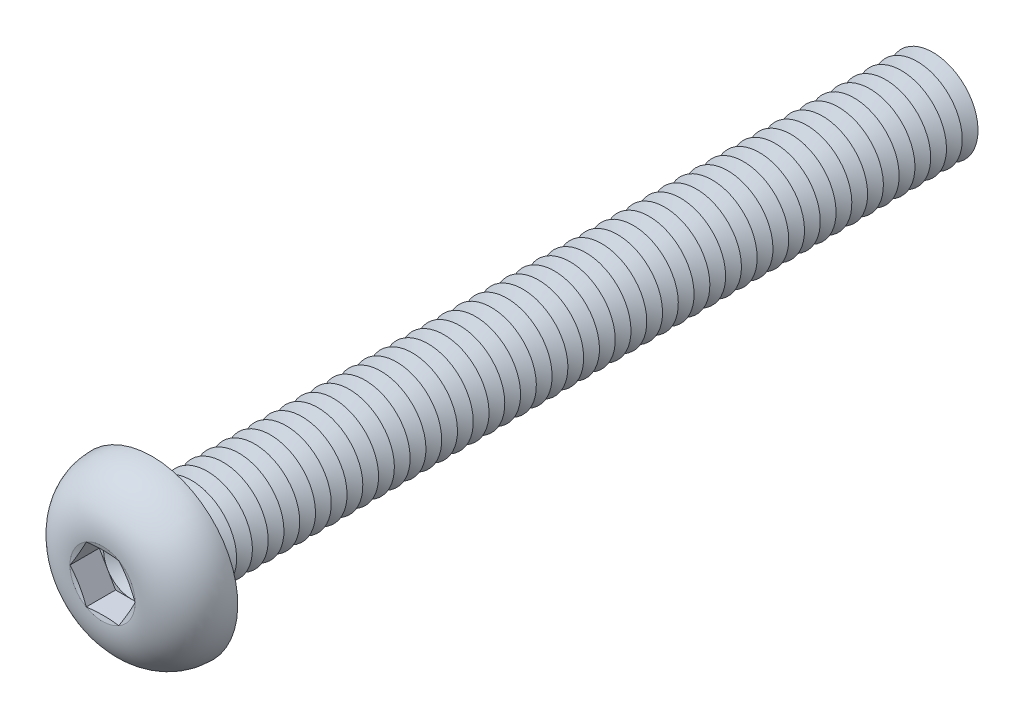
ISO-10303-21;
HEADER;
FILE_DESCRIPTION(('STEP AP214'),'2;1');
FILE_NAME('part.step','',(''),(''),'','','');
FILE_SCHEMA(('AUTOMOTIVE_DESIGN { 1 0 10303 214 1 1 1 1 }'));
ENDSEC;
DATA;
#1=APPLICATION_CONTEXT('core data for automotive mechanical design processes');
#2=APPLICATION_PROTOCOL_DEFINITION('international standard','automotive_design',2000,#1);
#3=PRODUCT_CONTEXT('',#1,'mechanical');
#4=PRODUCT('Part','Part','',(#3));
#5=PRODUCT_RELATED_PRODUCT_CATEGORY('part','',(#4));
#6=PRODUCT_DEFINITION_FORMATION('','',#4);
#7=PRODUCT_DEFINITION_CONTEXT('part definition',#1,'design');
#8=PRODUCT_DEFINITION('design','',#6,#7);
#9=PRODUCT_DEFINITION_SHAPE('','',#8);
#10=(LENGTH_UNIT() NAMED_UNIT(*) SI_UNIT(.MILLI.,.METRE.));
#11=(NAMED_UNIT(*) PLANE_ANGLE_UNIT() SI_UNIT($,.RADIAN.));
#12=(NAMED_UNIT(*) SI_UNIT($,.STERADIAN.) SOLID_ANGLE_UNIT());
#13=UNCERTAINTY_MEASURE_WITH_UNIT(LENGTH_MEASURE(1.E-05),#10,'distance_accuracy_value','');
#14=(GEOMETRIC_REPRESENTATION_CONTEXT(3) GLOBAL_UNCERTAINTY_ASSIGNED_CONTEXT((#13)) GLOBAL_UNIT_ASSIGNED_CONTEXT((#10,
#11,#12)) REPRESENTATION_CONTEXT('',''));
#15=CARTESIAN_POINT('',(0.,0.,0.));
#16=DIRECTION('',(0.,0.,1.));
#17=DIRECTION('',(1.,0.,0.));
#18=AXIS2_PLACEMENT_3D('',#15,#16,#17);
#19=CARTESIAN_POINT('',(0.,0.,0.899999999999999));
#20=DIRECTION('',(0.,0.,1.));
#21=DIRECTION('',(1.,0.,0.));
#22=AXIS2_PLACEMENT_3D('',#19,#20,#21);
#23=PLANE('',#22);
#24=CARTESIAN_POINT('',(0.,0.,0.899999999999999));
#25=DIRECTION('',(0.,0.,1.));
#26=DIRECTION('',(1.,0.,0.));
#27=AXIS2_PLACEMENT_3D('',#24,#25,#26);
#28=CIRCLE('',#27,1.24999941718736);
#29=CARTESIAN_POINT('',(1.08253125,0.624999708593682,0.899999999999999));
#30=VERTEX_POINT('',#29);
#31=CARTESIAN_POINT('',(0.,1.24999941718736,0.899999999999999));
#32=VERTEX_POINT('',#31);
#33=EDGE_CURVE('E118',#30,#32,#28,.T.);
#34=ORIENTED_EDGE('',*,*,#33,.F.);
#35=DIRECTION('',(-0.5,0.866025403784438,0.));
#36=VECTOR('',#35,1.);
#37=CARTESIAN_POINT('',(1.443375,0.,0.899999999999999));
#38=LINE('',#37,#36);
#39=CARTESIAN_POINT('',(0.7216875,1.24999941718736,0.899999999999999));
#40=VERTEX_POINT('',#39);
#41=EDGE_CURVE('E125',#30,#40,#38,.T.);
#42=ORIENTED_EDGE('',*,*,#41,.T.);
#43=DIRECTION('',(-1.,0.,0.));
#44=VECTOR('',#43,1.);
#45=CARTESIAN_POINT('',(0.7216875,1.24999941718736,0.899999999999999));
#46=LINE('',#45,#44);
#47=EDGE_CURVE('E136',#40,#32,#46,.T.);
#48=ORIENTED_EDGE('',*,*,#47,.T.);
#49=EDGE_LOOP('',(#34,#42,#48));
#50=FACE_BOUND('',#49,.T.);
#51=ADVANCED_FACE('F39',(#50),#23,.T.);
#52=CARTESIAN_POINT('',(0.,0.,0.899999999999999));
#53=DIRECTION('',(0.,0.,1.));
#54=DIRECTION('',(1.,0.,0.));
#55=AXIS2_PLACEMENT_3D('',#52,#53,#54);
#56=CIRCLE('',#55,1.24999941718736);
#57=CARTESIAN_POINT('',(-1.08253125,0.624999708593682,0.899999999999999));
#58=VERTEX_POINT('',#57);
#59=EDGE_CURVE('E11',#32,#58,#56,.T.);
#60=ORIENTED_EDGE('',*,*,#59,.F.);
#61=CARTESIAN_POINT('',(-0.721687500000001,1.24999941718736,0.899999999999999));
#62=VERTEX_POINT('',#61);
#63=EDGE_CURVE('E131',#32,#62,#46,.T.);
#64=ORIENTED_EDGE('',*,*,#63,.T.);
#65=DIRECTION('',(-0.5,-0.866025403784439,0.));
#66=VECTOR('',#65,1.);
#67=CARTESIAN_POINT('',(-0.721687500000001,1.24999941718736,0.899999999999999));
#68=LINE('',#67,#66);
#69=EDGE_CURVE('E134',#62,#58,#68,.T.);
#70=ORIENTED_EDGE('',*,*,#69,.T.);
#71=EDGE_LOOP('',(#60,#64,#70));
#72=FACE_BOUND('',#71,.T.);
#73=ADVANCED_FACE('F130',(#72),#23,.T.);
#74=CARTESIAN_POINT('',(-1.08253125,-0.624999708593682,0.899999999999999));
#75=VERTEX_POINT('',#74);
#76=EDGE_CURVE('E49',#58,#75,#56,.T.);
#77=ORIENTED_EDGE('',*,*,#76,.F.);
#78=CARTESIAN_POINT('',(-1.443375,0.,0.899999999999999));
#79=VERTEX_POINT('',#78);
#80=EDGE_CURVE('E143',#58,#79,#68,.T.);
#81=ORIENTED_EDGE('',*,*,#80,.T.);
#82=DIRECTION('',(0.5,-0.866025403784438,0.));
#83=VECTOR('',#82,1.);
#84=CARTESIAN_POINT('',(-1.443375,0.,0.899999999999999));
#85=LINE('',#84,#83);
#86=EDGE_CURVE('E152',#79,#75,#85,.T.);
#87=ORIENTED_EDGE('',*,*,#86,.T.);
#88=EDGE_LOOP('',(#77,#81,#87));
#89=FACE_BOUND('',#88,.T.);
#90=ADVANCED_FACE('F667',(#89),#23,.T.);
#91=CARTESIAN_POINT('',(0.,-1.24999941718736,0.899999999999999));
#92=VERTEX_POINT('',#91);
#93=EDGE_CURVE('E651',#75,#92,#56,.T.);
#94=ORIENTED_EDGE('',*,*,#93,.F.);
#95=CARTESIAN_POINT('',(-0.721687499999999,-1.24999941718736,0.899999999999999));
#96=VERTEX_POINT('',#95);
#97=EDGE_CURVE('E151',#75,#96,#85,.T.);
#98=ORIENTED_EDGE('',*,*,#97,.T.);
#99=DIRECTION('',(1.,0.,0.));
#100=VECTOR('',#99,1.);
#101=CARTESIAN_POINT('',(-0.721687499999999,-1.24999941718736,0.899999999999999));
#102=LINE('',#101,#100);
#103=EDGE_CURVE('E157',#96,#92,#102,.T.);
#104=ORIENTED_EDGE('',*,*,#103,.T.);
#105=EDGE_LOOP('',(#94,#98,#104));
#106=FACE_BOUND('',#105,.T.);
#107=ADVANCED_FACE('F660',(#106),#23,.T.);
#108=CARTESIAN_POINT('',(1.08253125,-0.624999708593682,0.899999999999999));
#109=VERTEX_POINT('',#108);
#110=EDGE_CURVE('E56',#92,#109,#56,.T.);
#111=ORIENTED_EDGE('',*,*,#110,.F.);
#112=CARTESIAN_POINT('',(0.721687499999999,-1.24999941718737,0.899999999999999));
#113=VERTEX_POINT('',#112);
#114=EDGE_CURVE('E156',#92,#113,#102,.T.);
#115=ORIENTED_EDGE('',*,*,#114,.T.);
#116=DIRECTION('',(0.5,0.866025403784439,0.));
#117=VECTOR('',#116,1.);
#118=CARTESIAN_POINT('',(0.721687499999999,-1.24999941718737,0.899999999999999));
#119=LINE('',#118,#117);
#120=EDGE_CURVE('E162',#113,#109,#119,.T.);
#121=ORIENTED_EDGE('',*,*,#120,.T.);
#122=EDGE_LOOP('',(#111,#115,#121));
#123=FACE_BOUND('',#122,.T.);
#124=ADVANCED_FACE('F736',(#123),#23,.T.);
#125=CARTESIAN_POINT('',(0.,0.,2.2));
#126=DIRECTION('',(0.,0.,1.));
#127=DIRECTION('',(0.,-1.,0.));
#128=AXIS2_PLACEMENT_3D('',#125,#126,#127);
#129=CONICAL_SURFACE('',#128,1.443375,1.30899693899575);
#130=CARTESIAN_POINT('',(1.44349047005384,-0.00020000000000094,2.20003094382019));
#131=CARTESIAN_POINT('',(1.41351104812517,0.0517258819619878,2.19199301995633));
#132=CARTESIAN_POINT('',(1.38347725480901,0.103745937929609,2.18469579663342));
#133=CARTESIAN_POINT('',(1.32330355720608,0.20796983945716,2.17187512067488));
#134=CARTESIAN_POINT('',(1.29316361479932,0.260173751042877,2.16635238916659));
#135=CARTESIAN_POINT('',(1.23296043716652,0.364448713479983,2.15740323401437));
#136=CARTESIAN_POINT('',(1.20289760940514,0.416519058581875,2.15396613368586));
#137=CARTESIAN_POINT('',(1.14273359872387,0.520726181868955,2.14935732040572));
#138=CARTESIAN_POINT('',(1.11263242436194,0.572862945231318,2.14818516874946));
#139=CARTESIAN_POINT('',(1.05243007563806,0.677136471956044,2.14818516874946));
#140=CARTESIAN_POINT('',(1.02232890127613,0.729273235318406,2.14935732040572));
#141=CARTESIAN_POINT('',(0.962164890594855,0.833480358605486,2.15396613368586));
#142=CARTESIAN_POINT('',(0.932102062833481,0.885550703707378,2.15740323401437));
#143=CARTESIAN_POINT('',(0.87189888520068,0.989825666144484,2.16635238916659));
#144=CARTESIAN_POINT('',(0.841758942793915,1.0420295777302,2.17187512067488));
#145=CARTESIAN_POINT('',(0.78158524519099,1.14625347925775,2.18469579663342));
#146=CARTESIAN_POINT('',(0.751551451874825,1.19827353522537,2.19199301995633));
#147=CARTESIAN_POINT('',(0.721572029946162,1.25019941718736,2.20003094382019));
#148=B_SPLINE_CURVE_WITH_KNOTS('',3,(#130,#131,#132,#133,#134,#135,#136,#137,#138,#139,#140,
#141,#142,#143,#144,#145,#146,#147),.UNSPECIFIED.,.F.,.F.,(4,2,2,2,2,2,2,2,4),(0.,
0.181495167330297,0.363063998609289,0.543695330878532,0.724291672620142,0.904888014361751,
1.08551934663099,1.26708817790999,1.44858334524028),.UNSPECIFIED.);
#149=CARTESIAN_POINT('',(1.443375,0.,2.2));
#150=VERTEX_POINT('',#149);
#151=CARTESIAN_POINT('',(0.72168750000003,1.24999941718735,2.2));
#152=VERTEX_POINT('',#151);
#153=EDGE_CURVE('E221',#150,#152,#148,.T.);
#154=ORIENTED_EDGE('',*,*,#153,.F.);
#155=CARTESIAN_POINT('',(0.,0.,2.2));
#156=DIRECTION('',(0.,0.,-1.));
#157=DIRECTION('',(0.,1.,0.));
#158=AXIS2_PLACEMENT_3D('',#155,#156,#157);
#159=CIRCLE('',#158,1.443375);
#160=EDGE_CURVE('E635',#152,#150,#159,.T.);
#161=ORIENTED_EDGE('',*,*,#160,.F.);
#162=EDGE_LOOP('',(#154,#161));
#163=FACE_BOUND('',#162,.T.);
#164=ADVANCED_FACE('F740',(#163),#129,.F.);
#165=CARTESIAN_POINT('',(0.721572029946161,-1.25019941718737,2.20003094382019));
#166=CARTESIAN_POINT('',(0.751551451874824,-1.19827353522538,2.19199301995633));
#167=CARTESIAN_POINT('',(0.78158524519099,-1.14625347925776,2.18469579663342));
#168=CARTESIAN_POINT('',(0.841758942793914,-1.0420295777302,2.17187512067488));
#169=CARTESIAN_POINT('',(0.871898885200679,-0.989825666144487,2.16635238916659));
#170=CARTESIAN_POINT('',(0.932102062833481,-0.885550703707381,2.15740323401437));
#171=CARTESIAN_POINT('',(0.962164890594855,-0.833480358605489,2.15396613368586));
#172=CARTESIAN_POINT('',(1.02232890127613,-0.729273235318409,2.14935732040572));
#173=CARTESIAN_POINT('',(1.05243007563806,-0.677136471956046,2.14818516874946));
#174=CARTESIAN_POINT('',(1.11263242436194,-0.57286294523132,2.14818516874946));
#175=CARTESIAN_POINT('',(1.14273359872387,-0.520726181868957,2.14935732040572));
#176=CARTESIAN_POINT('',(1.20289760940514,-0.416519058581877,2.15396613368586));
#177=CARTESIAN_POINT('',(1.23296043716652,-0.364448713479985,2.15740323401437));
#178=CARTESIAN_POINT('',(1.29316361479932,-0.260173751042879,2.16635238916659));
#179=CARTESIAN_POINT('',(1.32330355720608,-0.207969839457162,2.17187512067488));
#180=CARTESIAN_POINT('',(1.38347725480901,-0.103745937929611,2.18469579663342));
#181=CARTESIAN_POINT('',(1.41351104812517,-0.0517258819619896,2.19199301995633));
#182=CARTESIAN_POINT('',(1.44349047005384,0.00019999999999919,2.20003094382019));
#183=B_SPLINE_CURVE_WITH_KNOTS('',3,(#165,#166,#167,#168,#169,#170,#171,#172,#173,#174,#175,
#176,#177,#178,#179,#180,#181,#182),.UNSPECIFIED.,.F.,.F.,(4,2,2,2,2,2,2,2,4),(0.,
0.181495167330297,0.363063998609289,0.543695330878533,0.724291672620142,0.904888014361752,
1.085519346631,1.26708817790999,1.44858334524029),.UNSPECIFIED.);
#184=CARTESIAN_POINT('',(0.721687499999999,-1.24999941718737,2.2));
#185=VERTEX_POINT('',#184);
#186=EDGE_CURVE('E230',#185,#150,#183,.T.);
#187=ORIENTED_EDGE('',*,*,#186,.F.);
#188=EDGE_CURVE('E640',#150,#185,#159,.T.);
#189=ORIENTED_EDGE('',*,*,#188,.F.);
#190=EDGE_LOOP('',(#187,#189));
#191=FACE_BOUND('',#190,.T.);
#192=ADVANCED_FACE('F702',(#191),#129,.F.);
#193=CARTESIAN_POINT('',(-2.17815859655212,-1.24999941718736,2.48616275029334));
#194=CARTESIAN_POINT('',(-2.07269794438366,-1.24999941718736,2.46168811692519));
#195=CARTESIAN_POINT('',(-1.96714913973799,-1.24999941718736,2.43756889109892));
#196=CARTESIAN_POINT('',(-1.75576352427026,-1.24999941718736,2.39052699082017));
#197=CARTESIAN_POINT('',(-1.64992665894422,-1.24999941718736,2.36760456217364));
#198=CARTESIAN_POINT('',(-1.43690237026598,-1.24999941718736,2.3232454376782));
#199=CARTESIAN_POINT('',(-1.32971158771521,-1.24999941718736,2.30182468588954));
#200=CARTESIAN_POINT('',(-1.1148274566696,-1.24999941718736,2.26156703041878));
#201=CARTESIAN_POINT('',(-1.00713406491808,-1.24999941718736,2.24273035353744));
#202=CARTESIAN_POINT('',(-0.794044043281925,-1.24999941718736,2.2093913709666));
#203=CARTESIAN_POINT('',(-0.688664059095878,-1.24999941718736,2.19478562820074));
#204=CARTESIAN_POINT('',(-0.477310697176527,-1.24999941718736,2.17085809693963));
#205=CARTESIAN_POINT('',(-0.371337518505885,-1.24999941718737,2.16153463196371));
#206=CARTESIAN_POINT('',(-0.159455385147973,-1.24999941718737,2.14976770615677));
#207=CARTESIAN_POINT('',(-0.0535482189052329,-1.24999941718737,2.14729400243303));
#208=CARTESIAN_POINT('',(0.158189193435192,-1.24999941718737,2.14966287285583));
#209=CARTESIAN_POINT('',(0.264019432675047,-1.24999941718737,2.15450603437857));
#210=CARTESIAN_POINT('',(0.445148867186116,-1.24999941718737,2.16825380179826));
#211=CARTESIAN_POINT('',(0.520574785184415,-1.24999941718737,2.17561242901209));
#212=CARTESIAN_POINT('',(0.671115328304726,-1.24999941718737,2.19297000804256));
#213=CARTESIAN_POINT('',(0.746229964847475,-1.24999941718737,2.20296886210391));
#214=CARTESIAN_POINT('',(0.896387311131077,-1.24999941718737,2.22505910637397));
#215=CARTESIAN_POINT('',(0.971429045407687,-1.24999941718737,2.23715700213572));
#216=CARTESIAN_POINT('',(1.12124320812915,-1.24999941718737,2.26292371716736));
#217=CARTESIAN_POINT('',(1.19601562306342,-1.24999941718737,2.27659261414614));
#218=CARTESIAN_POINT('',(1.34686913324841,-1.24999941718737,2.30540811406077));
#219=CARTESIAN_POINT('',(1.42294548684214,-1.24999941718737,2.32057934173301));
#220=CARTESIAN_POINT('',(1.57490676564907,-1.24999941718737,2.351851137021));
#221=CARTESIAN_POINT('',(1.65079168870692,-1.24999941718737,2.36795171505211));
#222=CARTESIAN_POINT('',(1.80199501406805,-1.24999941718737,2.40076814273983));
#223=CARTESIAN_POINT('',(1.87731425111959,-1.24999941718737,2.41748016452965));
#224=CARTESIAN_POINT('',(2.02782424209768,-1.24999941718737,2.45144971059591));
#225=CARTESIAN_POINT('',(2.10301500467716,-1.24999941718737,2.46870719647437));
#226=CARTESIAN_POINT('',(2.17815859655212,-1.24999941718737,2.48616275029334));
#227=B_SPLINE_CURVE_WITH_KNOTS('',3,(#193,#194,#195,#196,#197,#198,#199,#200,#201,#202,#203,
#204,#205,#206,#207,#208,#209,#210,#211,#212,#213,#214,#215,#216,#217,#218,#219,#220,#221,#222,
#223,#224,#225,#226),.UNSPECIFIED.,.F.,.F.,(4,2,2,2,2,2,2,2,2,2,2,2,2,2,2,2,4),(0.,
0.324797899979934,0.649662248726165,0.977572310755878,1.30551113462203,1.62458166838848,
1.94355087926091,2.26110952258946,2.57869365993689,2.80599541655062,3.03328875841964,
3.26129956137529,3.48932164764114,3.7220371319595,3.95475522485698,4.18620606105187,
4.41764064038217),.UNSPECIFIED.);
#228=CARTESIAN_POINT('',(-0.721687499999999,-1.24999941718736,2.2));
#229=VERTEX_POINT('',#228);
#230=EDGE_CURVE('E681',#229,#185,#227,.T.);
#231=ORIENTED_EDGE('',*,*,#230,.F.);
#232=EDGE_CURVE('E694',#185,#229,#159,.T.);
#233=ORIENTED_EDGE('',*,*,#232,.F.);
#234=EDGE_LOOP('',(#231,#233));
#235=FACE_BOUND('',#234,.T.);
#236=ADVANCED_FACE('F708',(#235),#129,.F.);
#237=CARTESIAN_POINT('',(-1.44349047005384,0.000199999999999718,2.20003094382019));
#238=CARTESIAN_POINT('',(-1.41351104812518,-0.051725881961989,2.19199301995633));
#239=CARTESIAN_POINT('',(-1.38347725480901,-0.103745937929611,2.18469579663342));
#240=CARTESIAN_POINT('',(-1.32330355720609,-0.207969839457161,2.17187512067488));
#241=CARTESIAN_POINT('',(-1.29316361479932,-0.260173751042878,2.16635238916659));
#242=CARTESIAN_POINT('',(-1.23296043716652,-0.364448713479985,2.15740323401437));
#243=CARTESIAN_POINT('',(-1.20289760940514,-0.416519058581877,2.15396613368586));
#244=CARTESIAN_POINT('',(-1.14273359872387,-0.520726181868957,2.14935732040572));
#245=CARTESIAN_POINT('',(-1.11263242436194,-0.57286294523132,2.14818516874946));
#246=CARTESIAN_POINT('',(-1.05243007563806,-0.677136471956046,2.14818516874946));
#247=CARTESIAN_POINT('',(-1.02232890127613,-0.729273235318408,2.14935732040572));
#248=CARTESIAN_POINT('',(-0.962164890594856,-0.833480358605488,2.15396613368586));
#249=CARTESIAN_POINT('',(-0.932102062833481,-0.885550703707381,2.15740323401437));
#250=CARTESIAN_POINT('',(-0.87189888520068,-0.989825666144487,2.16635238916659));
#251=CARTESIAN_POINT('',(-0.841758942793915,-1.0420295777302,2.17187512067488));
#252=CARTESIAN_POINT('',(-0.78158524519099,-1.14625347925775,2.18469579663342));
#253=CARTESIAN_POINT('',(-0.751551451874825,-1.19827353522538,2.19199301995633));
#254=CARTESIAN_POINT('',(-0.721572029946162,-1.25019941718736,2.20003094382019));
#255=B_SPLINE_CURVE_WITH_KNOTS('',3,(#237,#238,#239,#240,#241,#242,#243,#244,#245,#246,#247,
#248,#249,#250,#251,#252,#253,#254),.UNSPECIFIED.,.F.,.F.,(4,2,2,2,2,2,2,2,4),(0.,
0.181495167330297,0.36306399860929,0.543695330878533,0.724291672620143,0.904888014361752,
1.085519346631,1.26708817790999,1.44858334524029),.UNSPECIFIED.);
#256=CARTESIAN_POINT('',(-1.443375,0.,2.2));
#257=VERTEX_POINT('',#256);
#258=EDGE_CURVE('E672',#257,#229,#255,.T.);
#259=ORIENTED_EDGE('',*,*,#258,.F.);
#260=EDGE_CURVE('E678',#229,#257,#159,.T.);
#261=ORIENTED_EDGE('',*,*,#260,.F.);
#262=EDGE_LOOP('',(#259,#261));
#263=FACE_BOUND('',#262,.T.);
#264=ADVANCED_FACE('F676',(#263),#129,.F.);
#265=CARTESIAN_POINT('',(-0.721572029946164,1.25019941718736,2.20003094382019));
#266=CARTESIAN_POINT('',(-0.751551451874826,1.19827353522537,2.19199301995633));
#267=CARTESIAN_POINT('',(-0.781585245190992,1.14625347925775,2.18469579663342));
#268=CARTESIAN_POINT('',(-0.841758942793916,1.0420295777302,2.17187512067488));
#269=CARTESIAN_POINT('',(-0.871898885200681,0.989825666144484,2.16635238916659));
#270=CARTESIAN_POINT('',(-0.932102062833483,0.885550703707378,2.15740323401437));
#271=CARTESIAN_POINT('',(-0.962164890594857,0.833480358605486,2.15396613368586));
#272=CARTESIAN_POINT('',(-1.02232890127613,0.729273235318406,2.14935732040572));
#273=CARTESIAN_POINT('',(-1.05243007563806,0.677136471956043,2.14818516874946));
#274=CARTESIAN_POINT('',(-1.11263242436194,0.572862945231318,2.14818516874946));
#275=CARTESIAN_POINT('',(-1.14273359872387,0.520726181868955,2.14935732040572));
#276=CARTESIAN_POINT('',(-1.20289760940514,0.416519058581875,2.15396613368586));
#277=CARTESIAN_POINT('',(-1.23296043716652,0.364448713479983,2.15740323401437));
#278=CARTESIAN_POINT('',(-1.29316361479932,0.260173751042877,2.16635238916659));
#279=CARTESIAN_POINT('',(-1.32330355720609,0.20796983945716,2.17187512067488));
#280=CARTESIAN_POINT('',(-1.38347725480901,0.10374593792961,2.18469579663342));
#281=CARTESIAN_POINT('',(-1.41351104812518,0.0517258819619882,2.19199301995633));
#282=CARTESIAN_POINT('',(-1.44349047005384,-0.000200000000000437,2.20003094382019));
#283=B_SPLINE_CURVE_WITH_KNOTS('',3,(#265,#266,#267,#268,#269,#270,#271,#272,#273,#274,#275,
#276,#277,#278,#279,#280,#281,#282),.UNSPECIFIED.,.F.,.F.,(4,2,2,2,2,2,2,2,4),(0.,
0.181495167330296,0.363063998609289,0.543695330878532,0.724291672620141,0.90488801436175,
1.08551934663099,1.26708817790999,1.44858334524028),.UNSPECIFIED.);
#284=CARTESIAN_POINT('',(-0.721687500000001,1.24999941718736,2.2));
#285=VERTEX_POINT('',#284);
#286=EDGE_CURVE('E195',#285,#257,#283,.T.);
#287=ORIENTED_EDGE('',*,*,#286,.F.);
#288=EDGE_CURVE('E684',#257,#285,#159,.T.);
#289=ORIENTED_EDGE('',*,*,#288,.F.);
#290=EDGE_LOOP('',(#287,#289));
#291=FACE_BOUND('',#290,.T.);
#292=ADVANCED_FACE('F685',(#291),#129,.F.);
#293=CARTESIAN_POINT('',(0.,0.,-32.55));
#294=DIRECTION('',(0.,0.,1.));
#295=DIRECTION('',(0.,-1.,0.));
#296=AXIS2_PLACEMENT_3D('',#293,#294,#295);
#297=CONICAL_SURFACE('',#296,1.99999999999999,1.04719755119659);
#298=CARTESIAN_POINT('',(0.,0.,-32.9));
#299=DIRECTION('',(0.,0.,1.));
#300=DIRECTION('',(0.,-1.,0.));
#301=AXIS2_PLACEMENT_3D('',#298,#299,#300);
#302=CIRCLE('',#301,1.39378221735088);
#303=CARTESIAN_POINT('',(0.,-1.39378221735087,-32.9));
#304=VERTEX_POINT('',#303);
#305=EDGE_CURVE('E607',#304,#304,#302,.T.);
#306=ORIENTED_EDGE('',*,*,#305,.T.);
#307=EDGE_LOOP('',(#306));
#308=FACE_BOUND('',#307,.T.);
#309=CARTESIAN_POINT('',(0.,0.,-32.55));
#310=DIRECTION('',(0.,0.,1.));
#311=DIRECTION('',(0.,-1.,0.));
#312=AXIS2_PLACEMENT_3D('',#309,#310,#311);
#313=CIRCLE('',#312,1.99999999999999);
#314=CARTESIAN_POINT('',(0.,-1.99999999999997,-32.55));
#315=VERTEX_POINT('',#314);
#316=EDGE_CURVE('E603',#315,#315,#313,.T.);
#317=ORIENTED_EDGE('',*,*,#316,.F.);
#318=EDGE_LOOP('',(#317));
#319=FACE_BOUND('',#318,.T.);
#320=ADVANCED_FACE('F769',(#308,#319),#297,.T.);
#321=CARTESIAN_POINT('',(0.,0.,-32.9));
#322=DIRECTION('',(0.,0.,-1.));
#323=DIRECTION('',(0.,1.,0.));
#324=AXIS2_PLACEMENT_3D('',#321,#322,#323);
#325=CONICAL_SURFACE('',#324,1.39378221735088,1.04719755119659);
#326=CARTESIAN_POINT('',(0.,0.,-33.25));
#327=DIRECTION('',(0.,0.,1.));
#328=DIRECTION('',(0.,-1.,0.));
#329=AXIS2_PLACEMENT_3D('',#326,#327,#328);
#330=CIRCLE('',#329,1.99999999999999);
#331=CARTESIAN_POINT('',(0.,-1.99999999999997,-33.25));
#332=VERTEX_POINT('',#331);
#333=EDGE_CURVE('E611',#332,#332,#330,.T.);
#334=ORIENTED_EDGE('',*,*,#333,.T.);
#335=EDGE_LOOP('',(#334));
#336=FACE_BOUND('',#335,.T.);
#337=ORIENTED_EDGE('',*,*,#305,.F.);
#338=EDGE_LOOP('',(#337));
#339=FACE_BOUND('',#338,.T.);
#340=ADVANCED_FACE('F774',(#336,#339),#325,.T.);
#341=CARTESIAN_POINT('',(0.,2.,-35.));
#342=DIRECTION('',(0.,0.,-1.));
#343=DIRECTION('',(0.,1.,0.));
#344=AXIS2_PLACEMENT_3D('',#341,#342,#343);
#345=PLANE('',#344);
#346=CARTESIAN_POINT('',(0.,0.,-35.));
#347=DIRECTION('',(0.,0.,1.));
#348=DIRECTION('',(0.,-1.,0.));
#349=AXIS2_PLACEMENT_3D('',#346,#347,#348);
#350=CIRCLE('',#349,1.39378221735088);
#351=CARTESIAN_POINT('',(0.,-1.39378221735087,-35.));
#352=VERTEX_POINT('',#351);
#353=EDGE_CURVE('E630',#352,#352,#350,.T.);
#354=ORIENTED_EDGE('',*,*,#353,.F.);
#355=EDGE_LOOP('',(#354));
#356=FACE_BOUND('',#355,.T.);
#357=ADVANCED_FACE('F941',(#356),#345,.T.);
#358=CARTESIAN_POINT('',(0.,0.,-34.65));
#359=DIRECTION('',(0.,0.,1.));
#360=DIRECTION('',(0.,-1.,0.));
#361=AXIS2_PLACEMENT_3D('',#358,#359,#360);
#362=CONICAL_SURFACE('',#361,1.99999999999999,1.04719755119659);
#363=ORIENTED_EDGE('',*,*,#353,.T.);
#364=EDGE_LOOP('',(#363));
#365=FACE_BOUND('',#364,.T.);
#366=CARTESIAN_POINT('',(0.,0.,-34.65));
#367=DIRECTION('',(0.,0.,1.));
#368=DIRECTION('',(0.,-1.,0.));
#369=AXIS2_PLACEMENT_3D('',#366,#367,#368);
#370=CIRCLE('',#369,1.99999999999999);
#371=CARTESIAN_POINT('',(0.,-1.99999999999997,-34.65));
#372=VERTEX_POINT('',#371);
#373=EDGE_CURVE('E626',#372,#372,#370,.T.);
#374=ORIENTED_EDGE('',*,*,#373,.F.);
#375=EDGE_LOOP('',(#374));
#376=FACE_BOUND('',#375,.T.);
#377=ADVANCED_FACE('F934',(#365,#376),#362,.T.);
#378=CARTESIAN_POINT('',(0.,0.,-34.3));
#379=DIRECTION('',(0.,0.,-1.));
#380=DIRECTION('',(0.,1.,0.));
#381=AXIS2_PLACEMENT_3D('',#378,#379,#380);
#382=CONICAL_SURFACE('',#381,1.39378221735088,1.04719755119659);
#383=ORIENTED_EDGE('',*,*,#373,.T.);
#384=EDGE_LOOP('',(#383));
#385=FACE_BOUND('',#384,.T.);
#386=CARTESIAN_POINT('',(0.,0.,-34.3));
#387=DIRECTION('',(0.,0.,1.));
#388=DIRECTION('',(0.,-1.,0.));
#389=AXIS2_PLACEMENT_3D('',#386,#387,#388);
#390=CIRCLE('',#389,1.39378221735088);
#391=CARTESIAN_POINT('',(0.,-1.39378221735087,-34.3));
#392=VERTEX_POINT('',#391);
#393=EDGE_CURVE('E623',#392,#392,#390,.T.);
#394=ORIENTED_EDGE('',*,*,#393,.F.);
#395=EDGE_LOOP('',(#394));
#396=FACE_BOUND('',#395,.T.);
#397=ADVANCED_FACE('F940',(#385,#396),#382,.T.);
#398=CARTESIAN_POINT('',(0.,0.,-33.95));
#399=DIRECTION('',(0.,0.,1.));
#400=DIRECTION('',(0.,-1.,0.));
#401=AXIS2_PLACEMENT_3D('',#398,#399,#400);
#402=CONICAL_SURFACE('',#401,1.99999999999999,1.04719755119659);
#403=ORIENTED_EDGE('',*,*,#393,.T.);
#404=EDGE_LOOP('',(#403));
#405=FACE_BOUND('',#404,.T.);
#406=CARTESIAN_POINT('',(0.,0.,-33.95));
#407=DIRECTION('',(0.,0.,1.));
#408=DIRECTION('',(0.,-1.,0.));
#409=AXIS2_PLACEMENT_3D('',#406,#407,#408);
#410=CIRCLE('',#409,1.99999999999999);
#411=CARTESIAN_POINT('',(0.,-1.99999999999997,-33.95));
#412=VERTEX_POINT('',#411);
#413=EDGE_CURVE('E619',#412,#412,#410,.T.);
#414=ORIENTED_EDGE('',*,*,#413,.F.);
#415=EDGE_LOOP('',(#414));
#416=FACE_BOUND('',#415,.T.);
#417=ADVANCED_FACE('F972',(#405,#416),#402,.T.);
#418=CARTESIAN_POINT('',(0.,0.,-33.6));
#419=DIRECTION('',(0.,0.,-1.));
#420=DIRECTION('',(0.,1.,0.));
#421=AXIS2_PLACEMENT_3D('',#418,#419,#420);
#422=CONICAL_SURFACE('',#421,1.39378221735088,1.04719755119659);
#423=ORIENTED_EDGE('',*,*,#413,.T.);
#424=EDGE_LOOP('',(#423));
#425=FACE_BOUND('',#424,.T.);
#426=CARTESIAN_POINT('',(0.,0.,-33.6));
#427=DIRECTION('',(0.,0.,1.));
#428=DIRECTION('',(0.,-1.,0.));
#429=AXIS2_PLACEMENT_3D('',#426,#427,#428);
#430=CIRCLE('',#429,1.39378221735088);
#431=CARTESIAN_POINT('',(0.,-1.39378221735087,-33.6));
#432=VERTEX_POINT('',#431);
#433=EDGE_CURVE('E615',#432,#432,#430,.T.);
#434=ORIENTED_EDGE('',*,*,#433,.F.);
#435=EDGE_LOOP('',(#434));
#436=FACE_BOUND('',#435,.T.);
#437=ADVANCED_FACE('F982',(#425,#436),#422,.T.);
#438=CARTESIAN_POINT('',(0.,0.,-33.25));
#439=DIRECTION('',(0.,0.,1.));
#440=DIRECTION('',(0.,-1.,0.));
#441=AXIS2_PLACEMENT_3D('',#438,#439,#440);
#442=CONICAL_SURFACE('',#441,1.99999999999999,1.04719755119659);
#443=ORIENTED_EDGE('',*,*,#433,.T.);
#444=EDGE_LOOP('',(#443));
#445=FACE_BOUND('',#444,.T.);
#446=ORIENTED_EDGE('',*,*,#333,.F.);
#447=EDGE_LOOP('',(#446));
#448=FACE_BOUND('',#447,.T.);
#449=ADVANCED_FACE('F992',(#445,#448),#442,.T.);
#450=CARTESIAN_POINT('',(0.,0.,-31.85));
#451=DIRECTION('',(0.,0.,1.));
#452=DIRECTION('',(0.,-1.,0.));
#453=AXIS2_PLACEMENT_3D('',#450,#451,#452);
#454=CONICAL_SURFACE('',#453,1.99999999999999,1.04719755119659);
#455=CARTESIAN_POINT('',(0.,0.,-32.2));
#456=DIRECTION('',(0.,0.,1.));
#457=DIRECTION('',(0.,-1.,0.));
#458=AXIS2_PLACEMENT_3D('',#455,#456,#457);
#459=CIRCLE('',#458,1.39378221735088);
#460=CARTESIAN_POINT('',(0.,-1.39378221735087,-32.2));
#461=VERTEX_POINT('',#460);
#462=EDGE_CURVE('E599',#461,#461,#459,.T.);
#463=ORIENTED_EDGE('',*,*,#462,.T.);
#464=EDGE_LOOP('',(#463));
#465=FACE_BOUND('',#464,.T.);
#466=CARTESIAN_POINT('',(0.,0.,-31.85));
#467=DIRECTION('',(0.,0.,1.));
#468=DIRECTION('',(0.,-1.,0.));
#469=AXIS2_PLACEMENT_3D('',#466,#467,#468);
#470=CIRCLE('',#469,1.99999999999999);
#471=CARTESIAN_POINT('',(0.,-1.99999999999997,-31.85));
#472=VERTEX_POINT('',#471);
#473=EDGE_CURVE('E595',#472,#472,#470,.T.);
#474=ORIENTED_EDGE('',*,*,#473,.F.);
#475=EDGE_LOOP('',(#474));
#476=FACE_BOUND('',#475,.T.);
#477=ADVANCED_FACE('F1002',(#465,#476),#454,.T.);
#478=CARTESIAN_POINT('',(0.,0.,-32.2));
#479=DIRECTION('',(0.,0.,-1.));
#480=DIRECTION('',(0.,1.,0.));
#481=AXIS2_PLACEMENT_3D('',#478,#479,#480);
#482=CONICAL_SURFACE('',#481,1.39378221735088,1.04719755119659);
#483=ORIENTED_EDGE('',*,*,#316,.T.);
#484=EDGE_LOOP('',(#483));
#485=FACE_BOUND('',#484,.T.);
#486=ORIENTED_EDGE('',*,*,#462,.F.);
#487=EDGE_LOOP('',(#486));
#488=FACE_BOUND('',#487,.T.);
#489=ADVANCED_FACE('F1012',(#485,#488),#482,.T.);
#490=CARTESIAN_POINT('',(0.,0.,-31.15));
#491=DIRECTION('',(0.,0.,1.));
#492=DIRECTION('',(0.,-1.,0.));
#493=AXIS2_PLACEMENT_3D('',#490,#491,#492);
#494=CONICAL_SURFACE('',#493,1.99999999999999,1.04719755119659);
#495=CARTESIAN_POINT('',(0.,0.,-31.5));
#496=DIRECTION('',(0.,0.,1.));
#497=DIRECTION('',(0.,-1.,0.));
#498=AXIS2_PLACEMENT_3D('',#495,#496,#497);
#499=CIRCLE('',#498,1.39378221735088);
#500=CARTESIAN_POINT('',(0.,-1.39378221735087,-31.5));
#501=VERTEX_POINT('',#500);
#502=EDGE_CURVE('E591',#501,#501,#499,.T.);
#503=ORIENTED_EDGE('',*,*,#502,.T.);
#504=EDGE_LOOP('',(#503));
#505=FACE_BOUND('',#504,.T.);
#506=CARTESIAN_POINT('',(0.,0.,-31.15));
#507=DIRECTION('',(0.,0.,1.));
#508=DIRECTION('',(0.,-1.,0.));
#509=AXIS2_PLACEMENT_3D('',#506,#507,#508);
#510=CIRCLE('',#509,1.99999999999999);
#511=CARTESIAN_POINT('',(0.,-1.99999999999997,-31.15));
#512=VERTEX_POINT('',#511);
#513=EDGE_CURVE('E587',#512,#512,#510,.T.);
#514=ORIENTED_EDGE('',*,*,#513,.F.);
#515=EDGE_LOOP('',(#514));
#516=FACE_BOUND('',#515,.T.);
#517=ADVANCED_FACE('F1022',(#505,#516),#494,.T.);
#518=CARTESIAN_POINT('',(0.,0.,-31.5));
#519=DIRECTION('',(0.,0.,-1.));
#520=DIRECTION('',(0.,1.,0.));
#521=AXIS2_PLACEMENT_3D('',#518,#519,#520);
#522=CONICAL_SURFACE('',#521,1.39378221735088,1.04719755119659);
#523=ORIENTED_EDGE('',*,*,#473,.T.);
#524=EDGE_LOOP('',(#523));
#525=FACE_BOUND('',#524,.T.);
#526=ORIENTED_EDGE('',*,*,#502,.F.);
#527=EDGE_LOOP('',(#526));
#528=FACE_BOUND('',#527,.T.);
#529=ADVANCED_FACE('F1032',(#525,#528),#522,.T.);
#530=CARTESIAN_POINT('',(0.,0.,-30.45));
#531=DIRECTION('',(0.,0.,1.));
#532=DIRECTION('',(0.,-1.,0.));
#533=AXIS2_PLACEMENT_3D('',#530,#531,#532);
#534=CONICAL_SURFACE('',#533,1.99999999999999,1.04719755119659);
#535=CARTESIAN_POINT('',(0.,0.,-30.8));
#536=DIRECTION('',(0.,0.,1.));
#537=DIRECTION('',(0.,-1.,0.));
#538=AXIS2_PLACEMENT_3D('',#535,#536,#537);
#539=CIRCLE('',#538,1.39378221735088);
#540=CARTESIAN_POINT('',(0.,-1.39378221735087,-30.8));
#541=VERTEX_POINT('',#540);
#542=EDGE_CURVE('E583',#541,#541,#539,.T.);
#543=ORIENTED_EDGE('',*,*,#542,.T.);
#544=EDGE_LOOP('',(#543));
#545=FACE_BOUND('',#544,.T.);
#546=CARTESIAN_POINT('',(0.,0.,-30.45));
#547=DIRECTION('',(0.,0.,1.));
#548=DIRECTION('',(0.,-1.,0.));
#549=AXIS2_PLACEMENT_3D('',#546,#547,#548);
#550=CIRCLE('',#549,1.99999999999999);
#551=CARTESIAN_POINT('',(0.,-1.99999999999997,-30.45));
#552=VERTEX_POINT('',#551);
#553=EDGE_CURVE('E579',#552,#552,#550,.T.);
#554=ORIENTED_EDGE('',*,*,#553,.F.);
#555=EDGE_LOOP('',(#554));
#556=FACE_BOUND('',#555,.T.);
#557=ADVANCED_FACE('F1042',(#545,#556),#534,.T.);
#558=CARTESIAN_POINT('',(0.,0.,-30.8));
#559=DIRECTION('',(0.,0.,-1.));
#560=DIRECTION('',(0.,1.,0.));
#561=AXIS2_PLACEMENT_3D('',#558,#559,#560);
#562=CONICAL_SURFACE('',#561,1.39378221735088,1.04719755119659);
#563=ORIENTED_EDGE('',*,*,#513,.T.);
#564=EDGE_LOOP('',(#563));
#565=FACE_BOUND('',#564,.T.);
#566=ORIENTED_EDGE('',*,*,#542,.F.);
#567=EDGE_LOOP('',(#566));
#568=FACE_BOUND('',#567,.T.);
#569=ADVANCED_FACE('F1052',(#565,#568),#562,.T.);
#570=CARTESIAN_POINT('',(0.,0.,-29.75));
#571=DIRECTION('',(0.,0.,1.));
#572=DIRECTION('',(0.,-1.,0.));
#573=AXIS2_PLACEMENT_3D('',#570,#571,#572);
#574=CONICAL_SURFACE('',#573,1.99999999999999,1.04719755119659);
#575=CARTESIAN_POINT('',(0.,0.,-30.1));
#576=DIRECTION('',(0.,0.,1.));
#577=DIRECTION('',(0.,-1.,0.));
#578=AXIS2_PLACEMENT_3D('',#575,#576,#577);
#579=CIRCLE('',#578,1.39378221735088);
#580=CARTESIAN_POINT('',(0.,-1.39378221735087,-30.1));
#581=VERTEX_POINT('',#580);
#582=EDGE_CURVE('E575',#581,#581,#579,.T.);
#583=ORIENTED_EDGE('',*,*,#582,.T.);
#584=EDGE_LOOP('',(#583));
#585=FACE_BOUND('',#584,.T.);
#586=CARTESIAN_POINT('',(0.,0.,-29.75));
#587=DIRECTION('',(0.,0.,1.));
#588=DIRECTION('',(0.,-1.,0.));
#589=AXIS2_PLACEMENT_3D('',#586,#587,#588);
#590=CIRCLE('',#589,1.99999999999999);
#591=CARTESIAN_POINT('',(0.,-1.99999999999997,-29.75));
#592=VERTEX_POINT('',#591);
#593=EDGE_CURVE('E571',#592,#592,#590,.T.);
#594=ORIENTED_EDGE('',*,*,#593,.F.);
#595=EDGE_LOOP('',(#594));
#596=FACE_BOUND('',#595,.T.);
#597=ADVANCED_FACE('F1062',(#585,#596),#574,.T.);
#598=CARTESIAN_POINT('',(0.,0.,-30.1));
#599=DIRECTION('',(0.,0.,-1.));
#600=DIRECTION('',(0.,1.,0.));
#601=AXIS2_PLACEMENT_3D('',#598,#599,#600);
#602=CONICAL_SURFACE('',#601,1.39378221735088,1.04719755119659);
#603=ORIENTED_EDGE('',*,*,#553,.T.);
#604=EDGE_LOOP('',(#603));
#605=FACE_BOUND('',#604,.T.);
#606=ORIENTED_EDGE('',*,*,#582,.F.);
#607=EDGE_LOOP('',(#606));
#608=FACE_BOUND('',#607,.T.);
#609=ADVANCED_FACE('F1072',(#605,#608),#602,.T.);
#610=CARTESIAN_POINT('',(0.,0.,-29.05));
#611=DIRECTION('',(0.,0.,1.));
#612=DIRECTION('',(0.,-1.,0.));
#613=AXIS2_PLACEMENT_3D('',#610,#611,#612);
#614=CONICAL_SURFACE('',#613,1.99999999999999,1.04719755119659);
#615=CARTESIAN_POINT('',(0.,0.,-29.4));
#616=DIRECTION('',(0.,0.,1.));
#617=DIRECTION('',(0.,-1.,0.));
#618=AXIS2_PLACEMENT_3D('',#615,#616,#617);
#619=CIRCLE('',#618,1.39378221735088);
#620=CARTESIAN_POINT('',(0.,-1.39378221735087,-29.4));
#621=VERTEX_POINT('',#620);
#622=EDGE_CURVE('E567',#621,#621,#619,.T.);
#623=ORIENTED_EDGE('',*,*,#622,.T.);
#624=EDGE_LOOP('',(#623));
#625=FACE_BOUND('',#624,.T.);
#626=CARTESIAN_POINT('',(0.,0.,-29.05));
#627=DIRECTION('',(0.,0.,1.));
#628=DIRECTION('',(0.,-1.,0.));
#629=AXIS2_PLACEMENT_3D('',#626,#627,#628);
#630=CIRCLE('',#629,1.99999999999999);
#631=CARTESIAN_POINT('',(0.,-1.99999999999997,-29.05));
#632=VERTEX_POINT('',#631);
#633=EDGE_CURVE('E563',#632,#632,#630,.T.);
#634=ORIENTED_EDGE('',*,*,#633,.F.);
#635=EDGE_LOOP('',(#634));
#636=FACE_BOUND('',#635,.T.);
#637=ADVANCED_FACE('F1082',(#625,#636),#614,.T.);
#638=CARTESIAN_POINT('',(0.,0.,-29.4));
#639=DIRECTION('',(0.,0.,-1.));
#640=DIRECTION('',(0.,1.,0.));
#641=AXIS2_PLACEMENT_3D('',#638,#639,#640);
#642=CONICAL_SURFACE('',#641,1.39378221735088,1.04719755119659);
#643=ORIENTED_EDGE('',*,*,#593,.T.);
#644=EDGE_LOOP('',(#643));
#645=FACE_BOUND('',#644,.T.);
#646=ORIENTED_EDGE('',*,*,#622,.F.);
#647=EDGE_LOOP('',(#646));
#648=FACE_BOUND('',#647,.T.);
#649=ADVANCED_FACE('F1092',(#645,#648),#642,.T.);
#650=CARTESIAN_POINT('',(0.,0.,-28.35));
#651=DIRECTION('',(0.,0.,1.));
#652=DIRECTION('',(0.,-1.,0.));
#653=AXIS2_PLACEMENT_3D('',#650,#651,#652);
#654=CONICAL_SURFACE('',#653,1.99999999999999,1.04719755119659);
#655=CARTESIAN_POINT('',(0.,0.,-28.7));
#656=DIRECTION('',(0.,0.,1.));
#657=DIRECTION('',(0.,-1.,0.));
#658=AXIS2_PLACEMENT_3D('',#655,#656,#657);
#659=CIRCLE('',#658,1.39378221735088);
#660=CARTESIAN_POINT('',(0.,-1.39378221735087,-28.7));
#661=VERTEX_POINT('',#660);
#662=EDGE_CURVE('E559',#661,#661,#659,.T.);
#663=ORIENTED_EDGE('',*,*,#662,.T.);
#664=EDGE_LOOP('',(#663));
#665=FACE_BOUND('',#664,.T.);
#666=CARTESIAN_POINT('',(0.,0.,-28.35));
#667=DIRECTION('',(0.,0.,1.));
#668=DIRECTION('',(0.,-1.,0.));
#669=AXIS2_PLACEMENT_3D('',#666,#667,#668);
#670=CIRCLE('',#669,1.99999999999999);
#671=CARTESIAN_POINT('',(0.,-1.99999999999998,-28.35));
#672=VERTEX_POINT('',#671);
#673=EDGE_CURVE('E555',#672,#672,#670,.T.);
#674=ORIENTED_EDGE('',*,*,#673,.F.);
#675=EDGE_LOOP('',(#674));
#676=FACE_BOUND('',#675,.T.);
#677=ADVANCED_FACE('F1102',(#665,#676),#654,.T.);
#678=CARTESIAN_POINT('',(0.,0.,-28.7));
#679=DIRECTION('',(0.,0.,-1.));
#680=DIRECTION('',(0.,1.,0.));
#681=AXIS2_PLACEMENT_3D('',#678,#679,#680);
#682=CONICAL_SURFACE('',#681,1.39378221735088,1.04719755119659);
#683=ORIENTED_EDGE('',*,*,#633,.T.);
#684=EDGE_LOOP('',(#683));
#685=FACE_BOUND('',#684,.T.);
#686=ORIENTED_EDGE('',*,*,#662,.F.);
#687=EDGE_LOOP('',(#686));
#688=FACE_BOUND('',#687,.T.);
#689=ADVANCED_FACE('F1112',(#685,#688),#682,.T.);
#690=CARTESIAN_POINT('',(0.,0.,-27.65));
#691=DIRECTION('',(0.,0.,1.));
#692=DIRECTION('',(0.,-1.,0.));
#693=AXIS2_PLACEMENT_3D('',#690,#691,#692);
#694=CONICAL_SURFACE('',#693,1.99999999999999,1.04719755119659);
#695=CARTESIAN_POINT('',(0.,0.,-28.));
#696=DIRECTION('',(0.,0.,1.));
#697=DIRECTION('',(0.,-1.,0.));
#698=AXIS2_PLACEMENT_3D('',#695,#696,#697);
#699=CIRCLE('',#698,1.39378221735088);
#700=CARTESIAN_POINT('',(0.,-1.39378221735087,-28.));
#701=VERTEX_POINT('',#700);
#702=EDGE_CURVE('E551',#701,#701,#699,.T.);
#703=ORIENTED_EDGE('',*,*,#702,.T.);
#704=EDGE_LOOP('',(#703));
#705=FACE_BOUND('',#704,.T.);
#706=CARTESIAN_POINT('',(0.,0.,-27.65));
#707=DIRECTION('',(0.,0.,1.));
#708=DIRECTION('',(0.,-1.,0.));
#709=AXIS2_PLACEMENT_3D('',#706,#707,#708);
#710=CIRCLE('',#709,1.99999999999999);
#711=CARTESIAN_POINT('',(0.,-1.99999999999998,-27.65));
#712=VERTEX_POINT('',#711);
#713=EDGE_CURVE('E547',#712,#712,#710,.T.);
#714=ORIENTED_EDGE('',*,*,#713,.F.);
#715=EDGE_LOOP('',(#714));
#716=FACE_BOUND('',#715,.T.);
#717=ADVANCED_FACE('F1122',(#705,#716),#694,.T.);
#718=CARTESIAN_POINT('',(0.,0.,-28.));
#719=DIRECTION('',(0.,0.,-1.));
#720=DIRECTION('',(0.,1.,0.));
#721=AXIS2_PLACEMENT_3D('',#718,#719,#720);
#722=CONICAL_SURFACE('',#721,1.39378221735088,1.04719755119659);
#723=ORIENTED_EDGE('',*,*,#673,.T.);
#724=EDGE_LOOP('',(#723));
#725=FACE_BOUND('',#724,.T.);
#726=ORIENTED_EDGE('',*,*,#702,.F.);
#727=EDGE_LOOP('',(#726));
#728=FACE_BOUND('',#727,.T.);
#729=ADVANCED_FACE('F1132',(#725,#728),#722,.T.);
#730=CARTESIAN_POINT('',(0.,0.,-26.95));
#731=DIRECTION('',(0.,0.,1.));
#732=DIRECTION('',(0.,-1.,0.));
#733=AXIS2_PLACEMENT_3D('',#730,#731,#732);
#734=CONICAL_SURFACE('',#733,1.99999999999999,1.04719755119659);
#735=CARTESIAN_POINT('',(0.,0.,-27.3));
#736=DIRECTION('',(0.,0.,1.));
#737=DIRECTION('',(0.,-1.,0.));
#738=AXIS2_PLACEMENT_3D('',#735,#736,#737);
#739=CIRCLE('',#738,1.39378221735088);
#740=CARTESIAN_POINT('',(0.,-1.39378221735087,-27.3));
#741=VERTEX_POINT('',#740);
#742=EDGE_CURVE('E543',#741,#741,#739,.T.);
#743=ORIENTED_EDGE('',*,*,#742,.T.);
#744=EDGE_LOOP('',(#743));
#745=FACE_BOUND('',#744,.T.);
#746=CARTESIAN_POINT('',(0.,0.,-26.95));
#747=DIRECTION('',(0.,0.,1.));
#748=DIRECTION('',(0.,-1.,0.));
#749=AXIS2_PLACEMENT_3D('',#746,#747,#748);
#750=CIRCLE('',#749,1.99999999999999);
#751=CARTESIAN_POINT('',(0.,-1.99999999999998,-26.95));
#752=VERTEX_POINT('',#751);
#753=EDGE_CURVE('E539',#752,#752,#750,.T.);
#754=ORIENTED_EDGE('',*,*,#753,.F.);
#755=EDGE_LOOP('',(#754));
#756=FACE_BOUND('',#755,.T.);
#757=ADVANCED_FACE('F1142',(#745,#756),#734,.T.);
#758=CARTESIAN_POINT('',(0.,0.,-27.3));
#759=DIRECTION('',(0.,0.,-1.));
#760=DIRECTION('',(0.,1.,0.));
#761=AXIS2_PLACEMENT_3D('',#758,#759,#760);
#762=CONICAL_SURFACE('',#761,1.39378221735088,1.04719755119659);
#763=ORIENTED_EDGE('',*,*,#713,.T.);
#764=EDGE_LOOP('',(#763));
#765=FACE_BOUND('',#764,.T.);
#766=ORIENTED_EDGE('',*,*,#742,.F.);
#767=EDGE_LOOP('',(#766));
#768=FACE_BOUND('',#767,.T.);
#769=ADVANCED_FACE('F1152',(#765,#768),#762,.T.);
#770=CARTESIAN_POINT('',(0.,0.,-26.25));
#771=DIRECTION('',(0.,0.,1.));
#772=DIRECTION('',(0.,-1.,0.));
#773=AXIS2_PLACEMENT_3D('',#770,#771,#772);
#774=CONICAL_SURFACE('',#773,1.99999999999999,1.04719755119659);
#775=CARTESIAN_POINT('',(0.,0.,-26.6));
#776=DIRECTION('',(0.,0.,1.));
#777=DIRECTION('',(0.,-1.,0.));
#778=AXIS2_PLACEMENT_3D('',#775,#776,#777);
#779=CIRCLE('',#778,1.39378221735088);
#780=CARTESIAN_POINT('',(0.,-1.39378221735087,-26.6));
#781=VERTEX_POINT('',#780);
#782=EDGE_CURVE('E535',#781,#781,#779,.T.);
#783=ORIENTED_EDGE('',*,*,#782,.T.);
#784=EDGE_LOOP('',(#783));
#785=FACE_BOUND('',#784,.T.);
#786=CARTESIAN_POINT('',(0.,0.,-26.25));
#787=DIRECTION('',(0.,0.,1.));
#788=DIRECTION('',(0.,-1.,0.));
#789=AXIS2_PLACEMENT_3D('',#786,#787,#788);
#790=CIRCLE('',#789,1.99999999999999);
#791=CARTESIAN_POINT('',(0.,-1.99999999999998,-26.25));
#792=VERTEX_POINT('',#791);
#793=EDGE_CURVE('E531',#792,#792,#790,.T.);
#794=ORIENTED_EDGE('',*,*,#793,.F.);
#795=EDGE_LOOP('',(#794));
#796=FACE_BOUND('',#795,.T.);
#797=ADVANCED_FACE('F1162',(#785,#796),#774,.T.);
#798=CARTESIAN_POINT('',(0.,0.,-26.6));
#799=DIRECTION('',(0.,0.,-1.));
#800=DIRECTION('',(0.,1.,0.));
#801=AXIS2_PLACEMENT_3D('',#798,#799,#800);
#802=CONICAL_SURFACE('',#801,1.39378221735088,1.04719755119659);
#803=ORIENTED_EDGE('',*,*,#753,.T.);
#804=EDGE_LOOP('',(#803));
#805=FACE_BOUND('',#804,.T.);
#806=ORIENTED_EDGE('',*,*,#782,.F.);
#807=EDGE_LOOP('',(#806));
#808=FACE_BOUND('',#807,.T.);
#809=ADVANCED_FACE('F1172',(#805,#808),#802,.T.);
#810=CARTESIAN_POINT('',(0.,0.,-25.55));
#811=DIRECTION('',(0.,0.,1.));
#812=DIRECTION('',(0.,-1.,0.));
#813=AXIS2_PLACEMENT_3D('',#810,#811,#812);
#814=CONICAL_SURFACE('',#813,1.99999999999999,1.04719755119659);
#815=CARTESIAN_POINT('',(0.,0.,-25.9));
#816=DIRECTION('',(0.,0.,1.));
#817=DIRECTION('',(0.,-1.,0.));
#818=AXIS2_PLACEMENT_3D('',#815,#816,#817);
#819=CIRCLE('',#818,1.39378221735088);
#820=CARTESIAN_POINT('',(0.,-1.39378221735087,-25.9));
#821=VERTEX_POINT('',#820);
#822=EDGE_CURVE('E527',#821,#821,#819,.T.);
#823=ORIENTED_EDGE('',*,*,#822,.T.);
#824=EDGE_LOOP('',(#823));
#825=FACE_BOUND('',#824,.T.);
#826=CARTESIAN_POINT('',(0.,0.,-25.55));
#827=DIRECTION('',(0.,0.,1.));
#828=DIRECTION('',(0.,-1.,0.));
#829=AXIS2_PLACEMENT_3D('',#826,#827,#828);
#830=CIRCLE('',#829,1.99999999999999);
#831=CARTESIAN_POINT('',(0.,-1.99999999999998,-25.55));
#832=VERTEX_POINT('',#831);
#833=EDGE_CURVE('E523',#832,#832,#830,.T.);
#834=ORIENTED_EDGE('',*,*,#833,.F.);
#835=EDGE_LOOP('',(#834));
#836=FACE_BOUND('',#835,.T.);
#837=ADVANCED_FACE('F1182',(#825,#836),#814,.T.);
#838=CARTESIAN_POINT('',(0.,0.,-25.9));
#839=DIRECTION('',(0.,0.,-1.));
#840=DIRECTION('',(0.,1.,0.));
#841=AXIS2_PLACEMENT_3D('',#838,#839,#840);
#842=CONICAL_SURFACE('',#841,1.39378221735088,1.04719755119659);
#843=ORIENTED_EDGE('',*,*,#793,.T.);
#844=EDGE_LOOP('',(#843));
#845=FACE_BOUND('',#844,.T.);
#846=ORIENTED_EDGE('',*,*,#822,.F.);
#847=EDGE_LOOP('',(#846));
#848=FACE_BOUND('',#847,.T.);
#849=ADVANCED_FACE('F1192',(#845,#848),#842,.T.);
#850=CARTESIAN_POINT('',(0.,0.,-24.85));
#851=DIRECTION('',(0.,0.,1.));
#852=DIRECTION('',(0.,-1.,0.));
#853=AXIS2_PLACEMENT_3D('',#850,#851,#852);
#854=CONICAL_SURFACE('',#853,1.99999999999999,1.04719755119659);
#855=CARTESIAN_POINT('',(0.,0.,-25.2));
#856=DIRECTION('',(0.,0.,1.));
#857=DIRECTION('',(0.,-1.,0.));
#858=AXIS2_PLACEMENT_3D('',#855,#856,#857);
#859=CIRCLE('',#858,1.39378221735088);
#860=CARTESIAN_POINT('',(0.,-1.39378221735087,-25.2));
#861=VERTEX_POINT('',#860);
#862=EDGE_CURVE('E519',#861,#861,#859,.T.);
#863=ORIENTED_EDGE('',*,*,#862,.T.);
#864=EDGE_LOOP('',(#863));
#865=FACE_BOUND('',#864,.T.);
#866=CARTESIAN_POINT('',(0.,0.,-24.85));
#867=DIRECTION('',(0.,0.,1.));
#868=DIRECTION('',(0.,-1.,0.));
#869=AXIS2_PLACEMENT_3D('',#866,#867,#868);
#870=CIRCLE('',#869,1.99999999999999);
#871=CARTESIAN_POINT('',(0.,-1.99999999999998,-24.85));
#872=VERTEX_POINT('',#871);
#873=EDGE_CURVE('E515',#872,#872,#870,.T.);
#874=ORIENTED_EDGE('',*,*,#873,.F.);
#875=EDGE_LOOP('',(#874));
#876=FACE_BOUND('',#875,.T.);
#877=ADVANCED_FACE('F1202',(#865,#876),#854,.T.);
#878=CARTESIAN_POINT('',(0.,0.,-25.2));
#879=DIRECTION('',(0.,0.,-1.));
#880=DIRECTION('',(0.,1.,0.));
#881=AXIS2_PLACEMENT_3D('',#878,#879,#880);
#882=CONICAL_SURFACE('',#881,1.39378221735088,1.04719755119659);
#883=ORIENTED_EDGE('',*,*,#833,.T.);
#884=EDGE_LOOP('',(#883));
#885=FACE_BOUND('',#884,.T.);
#886=ORIENTED_EDGE('',*,*,#862,.F.);
#887=EDGE_LOOP('',(#886));
#888=FACE_BOUND('',#887,.T.);
#889=ADVANCED_FACE('F1212',(#885,#888),#882,.T.);
#890=CARTESIAN_POINT('',(0.,0.,-24.15));
#891=DIRECTION('',(0.,0.,1.));
#892=DIRECTION('',(0.,-1.,0.));
#893=AXIS2_PLACEMENT_3D('',#890,#891,#892);
#894=CONICAL_SURFACE('',#893,1.99999999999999,1.04719755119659);
#895=CARTESIAN_POINT('',(0.,0.,-24.5));
#896=DIRECTION('',(0.,0.,1.));
#897=DIRECTION('',(0.,-1.,0.));
#898=AXIS2_PLACEMENT_3D('',#895,#896,#897);
#899=CIRCLE('',#898,1.39378221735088);
#900=CARTESIAN_POINT('',(0.,-1.39378221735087,-24.5));
#901=VERTEX_POINT('',#900);
#902=EDGE_CURVE('E511',#901,#901,#899,.T.);
#903=ORIENTED_EDGE('',*,*,#902,.T.);
#904=EDGE_LOOP('',(#903));
#905=FACE_BOUND('',#904,.T.);
#906=CARTESIAN_POINT('',(0.,0.,-24.15));
#907=DIRECTION('',(0.,0.,1.));
#908=DIRECTION('',(0.,-1.,0.));
#909=AXIS2_PLACEMENT_3D('',#906,#907,#908);
#910=CIRCLE('',#909,1.99999999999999);
#911=CARTESIAN_POINT('',(0.,-1.99999999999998,-24.15));
#912=VERTEX_POINT('',#911);
#913=EDGE_CURVE('E507',#912,#912,#910,.T.);
#914=ORIENTED_EDGE('',*,*,#913,.F.);
#915=EDGE_LOOP('',(#914));
#916=FACE_BOUND('',#915,.T.);
#917=ADVANCED_FACE('F1222',(#905,#916),#894,.T.);
#918=CARTESIAN_POINT('',(0.,0.,-24.5));
#919=DIRECTION('',(0.,0.,-1.));
#920=DIRECTION('',(0.,1.,0.));
#921=AXIS2_PLACEMENT_3D('',#918,#919,#920);
#922=CONICAL_SURFACE('',#921,1.39378221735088,1.04719755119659);
#923=ORIENTED_EDGE('',*,*,#873,.T.);
#924=EDGE_LOOP('',(#923));
#925=FACE_BOUND('',#924,.T.);
#926=ORIENTED_EDGE('',*,*,#902,.F.);
#927=EDGE_LOOP('',(#926));
#928=FACE_BOUND('',#927,.T.);
#929=ADVANCED_FACE('F1232',(#925,#928),#922,.T.);
#930=CARTESIAN_POINT('',(0.,0.,-23.45));
#931=DIRECTION('',(0.,0.,1.));
#932=DIRECTION('',(0.,-1.,0.));
#933=AXIS2_PLACEMENT_3D('',#930,#931,#932);
#934=CONICAL_SURFACE('',#933,1.99999999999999,1.04719755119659);
#935=CARTESIAN_POINT('',(0.,0.,-23.8));
#936=DIRECTION('',(0.,0.,1.));
#937=DIRECTION('',(0.,-1.,0.));
#938=AXIS2_PLACEMENT_3D('',#935,#936,#937);
#939=CIRCLE('',#938,1.39378221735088);
#940=CARTESIAN_POINT('',(0.,-1.39378221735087,-23.8));
#941=VERTEX_POINT('',#940);
#942=EDGE_CURVE('E503',#941,#941,#939,.T.);
#943=ORIENTED_EDGE('',*,*,#942,.T.);
#944=EDGE_LOOP('',(#943));
#945=FACE_BOUND('',#944,.T.);
#946=CARTESIAN_POINT('',(0.,0.,-23.45));
#947=DIRECTION('',(0.,0.,1.));
#948=DIRECTION('',(0.,-1.,0.));
#949=AXIS2_PLACEMENT_3D('',#946,#947,#948);
#950=CIRCLE('',#949,1.99999999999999);
#951=CARTESIAN_POINT('',(0.,-1.99999999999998,-23.45));
#952=VERTEX_POINT('',#951);
#953=EDGE_CURVE('E499',#952,#952,#950,.T.);
#954=ORIENTED_EDGE('',*,*,#953,.F.);
#955=EDGE_LOOP('',(#954));
#956=FACE_BOUND('',#955,.T.);
#957=ADVANCED_FACE('F1242',(#945,#956),#934,.T.);
#958=CARTESIAN_POINT('',(0.,0.,-23.8));
#959=DIRECTION('',(0.,0.,-1.));
#960=DIRECTION('',(0.,1.,0.));
#961=AXIS2_PLACEMENT_3D('',#958,#959,#960);
#962=CONICAL_SURFACE('',#961,1.39378221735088,1.04719755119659);
#963=ORIENTED_EDGE('',*,*,#913,.T.);
#964=EDGE_LOOP('',(#963));
#965=FACE_BOUND('',#964,.T.);
#966=ORIENTED_EDGE('',*,*,#942,.F.);
#967=EDGE_LOOP('',(#966));
#968=FACE_BOUND('',#967,.T.);
#969=ADVANCED_FACE('F1252',(#965,#968),#962,.T.);
#970=CARTESIAN_POINT('',(0.,0.,-22.75));
#971=DIRECTION('',(0.,0.,1.));
#972=DIRECTION('',(0.,-1.,0.));
#973=AXIS2_PLACEMENT_3D('',#970,#971,#972);
#974=CONICAL_SURFACE('',#973,1.99999999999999,1.04719755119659);
#975=CARTESIAN_POINT('',(0.,0.,-23.1));
#976=DIRECTION('',(0.,0.,1.));
#977=DIRECTION('',(0.,-1.,0.));
#978=AXIS2_PLACEMENT_3D('',#975,#976,#977);
#979=CIRCLE('',#978,1.39378221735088);
#980=CARTESIAN_POINT('',(0.,-1.39378221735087,-23.1));
#981=VERTEX_POINT('',#980);
#982=EDGE_CURVE('E495',#981,#981,#979,.T.);
#983=ORIENTED_EDGE('',*,*,#982,.T.);
#984=EDGE_LOOP('',(#983));
#985=FACE_BOUND('',#984,.T.);
#986=CARTESIAN_POINT('',(0.,0.,-22.75));
#987=DIRECTION('',(0.,0.,1.));
#988=DIRECTION('',(0.,-1.,0.));
#989=AXIS2_PLACEMENT_3D('',#986,#987,#988);
#990=CIRCLE('',#989,1.99999999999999);
#991=CARTESIAN_POINT('',(0.,-1.99999999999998,-22.75));
#992=VERTEX_POINT('',#991);
#993=EDGE_CURVE('E491',#992,#992,#990,.T.);
#994=ORIENTED_EDGE('',*,*,#993,.F.);
#995=EDGE_LOOP('',(#994));
#996=FACE_BOUND('',#995,.T.);
#997=ADVANCED_FACE('F1262',(#985,#996),#974,.T.);
#998=CARTESIAN_POINT('',(0.,0.,-23.1));
#999=DIRECTION('',(0.,0.,-1.));
#1000=DIRECTION('',(0.,1.,0.));
#1001=AXIS2_PLACEMENT_3D('',#998,#999,#1000);
#1002=CONICAL_SURFACE('',#1001,1.39378221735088,1.04719755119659);
#1003=ORIENTED_EDGE('',*,*,#953,.T.);
#1004=EDGE_LOOP('',(#1003));
#1005=FACE_BOUND('',#1004,.T.);
#1006=ORIENTED_EDGE('',*,*,#982,.F.);
#1007=EDGE_LOOP('',(#1006));
#1008=FACE_BOUND('',#1007,.T.);
#1009=ADVANCED_FACE('F1272',(#1005,#1008),#1002,.T.);
#1010=CARTESIAN_POINT('',(0.,0.,-22.05));
#1011=DIRECTION('',(0.,0.,1.));
#1012=DIRECTION('',(0.,-1.,0.));
#1013=AXIS2_PLACEMENT_3D('',#1010,#1011,#1012);
#1014=CONICAL_SURFACE('',#1013,1.99999999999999,1.04719755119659);
#1015=CARTESIAN_POINT('',(0.,0.,-22.4));
#1016=DIRECTION('',(0.,0.,1.));
#1017=DIRECTION('',(0.,-1.,0.));
#1018=AXIS2_PLACEMENT_3D('',#1015,#1016,#1017);
#1019=CIRCLE('',#1018,1.39378221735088);
#1020=CARTESIAN_POINT('',(0.,-1.39378221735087,-22.4));
#1021=VERTEX_POINT('',#1020);
#1022=EDGE_CURVE('E487',#1021,#1021,#1019,.T.);
#1023=ORIENTED_EDGE('',*,*,#1022,.T.);
#1024=EDGE_LOOP('',(#1023));
#1025=FACE_BOUND('',#1024,.T.);
#1026=CARTESIAN_POINT('',(0.,0.,-22.05));
#1027=DIRECTION('',(0.,0.,1.));
#1028=DIRECTION('',(0.,-1.,0.));
#1029=AXIS2_PLACEMENT_3D('',#1026,#1027,#1028);
#1030=CIRCLE('',#1029,1.99999999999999);
#1031=CARTESIAN_POINT('',(0.,-1.99999999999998,-22.05));
#1032=VERTEX_POINT('',#1031);
#1033=EDGE_CURVE('E483',#1032,#1032,#1030,.T.);
#1034=ORIENTED_EDGE('',*,*,#1033,.F.);
#1035=EDGE_LOOP('',(#1034));
#1036=FACE_BOUND('',#1035,.T.);
#1037=ADVANCED_FACE('F1282',(#1025,#1036),#1014,.T.);
#1038=CARTESIAN_POINT('',(0.,0.,-22.4));
#1039=DIRECTION('',(0.,0.,-1.));
#1040=DIRECTION('',(0.,1.,0.));
#1041=AXIS2_PLACEMENT_3D('',#1038,#1039,#1040);
#1042=CONICAL_SURFACE('',#1041,1.39378221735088,1.04719755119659);
#1043=ORIENTED_EDGE('',*,*,#993,.T.);
#1044=EDGE_LOOP('',(#1043));
#1045=FACE_BOUND('',#1044,.T.);
#1046=ORIENTED_EDGE('',*,*,#1022,.F.);
#1047=EDGE_LOOP('',(#1046));
#1048=FACE_BOUND('',#1047,.T.);
#1049=ADVANCED_FACE('F1292',(#1045,#1048),#1042,.T.);
#1050=CARTESIAN_POINT('',(0.,0.,-21.35));
#1051=DIRECTION('',(0.,0.,1.));
#1052=DIRECTION('',(0.,-1.,0.));
#1053=AXIS2_PLACEMENT_3D('',#1050,#1051,#1052);
#1054=CONICAL_SURFACE('',#1053,1.99999999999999,1.04719755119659);
#1055=CARTESIAN_POINT('',(0.,0.,-21.7));
#1056=DIRECTION('',(0.,0.,1.));
#1057=DIRECTION('',(0.,-1.,0.));
#1058=AXIS2_PLACEMENT_3D('',#1055,#1056,#1057);
#1059=CIRCLE('',#1058,1.39378221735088);
#1060=CARTESIAN_POINT('',(0.,-1.39378221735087,-21.7));
#1061=VERTEX_POINT('',#1060);
#1062=EDGE_CURVE('E479',#1061,#1061,#1059,.T.);
#1063=ORIENTED_EDGE('',*,*,#1062,.T.);
#1064=EDGE_LOOP('',(#1063));
#1065=FACE_BOUND('',#1064,.T.);
#1066=CARTESIAN_POINT('',(0.,0.,-21.35));
#1067=DIRECTION('',(0.,0.,1.));
#1068=DIRECTION('',(0.,-1.,0.));
#1069=AXIS2_PLACEMENT_3D('',#1066,#1067,#1068);
#1070=CIRCLE('',#1069,1.99999999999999);
#1071=CARTESIAN_POINT('',(0.,-1.99999999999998,-21.35));
#1072=VERTEX_POINT('',#1071);
#1073=EDGE_CURVE('E475',#1072,#1072,#1070,.T.);
#1074=ORIENTED_EDGE('',*,*,#1073,.F.);
#1075=EDGE_LOOP('',(#1074));
#1076=FACE_BOUND('',#1075,.T.);
#1077=ADVANCED_FACE('F1302',(#1065,#1076),#1054,.T.);
#1078=CARTESIAN_POINT('',(0.,0.,-21.7));
#1079=DIRECTION('',(0.,0.,-1.));
#1080=DIRECTION('',(0.,1.,0.));
#1081=AXIS2_PLACEMENT_3D('',#1078,#1079,#1080);
#1082=CONICAL_SURFACE('',#1081,1.39378221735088,1.04719755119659);
#1083=ORIENTED_EDGE('',*,*,#1033,.T.);
#1084=EDGE_LOOP('',(#1083));
#1085=FACE_BOUND('',#1084,.T.);
#1086=ORIENTED_EDGE('',*,*,#1062,.F.);
#1087=EDGE_LOOP('',(#1086));
#1088=FACE_BOUND('',#1087,.T.);
#1089=ADVANCED_FACE('F1312',(#1085,#1088),#1082,.T.);
#1090=CARTESIAN_POINT('',(0.,0.,-20.65));
#1091=DIRECTION('',(0.,0.,1.));
#1092=DIRECTION('',(0.,-1.,0.));
#1093=AXIS2_PLACEMENT_3D('',#1090,#1091,#1092);
#1094=CONICAL_SURFACE('',#1093,1.99999999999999,1.04719755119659);
#1095=CARTESIAN_POINT('',(0.,0.,-21.));
#1096=DIRECTION('',(0.,0.,1.));
#1097=DIRECTION('',(0.,-1.,0.));
#1098=AXIS2_PLACEMENT_3D('',#1095,#1096,#1097);
#1099=CIRCLE('',#1098,1.39378221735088);
#1100=CARTESIAN_POINT('',(0.,-1.39378221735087,-21.));
#1101=VERTEX_POINT('',#1100);
#1102=EDGE_CURVE('E471',#1101,#1101,#1099,.T.);
#1103=ORIENTED_EDGE('',*,*,#1102,.T.);
#1104=EDGE_LOOP('',(#1103));
#1105=FACE_BOUND('',#1104,.T.);
#1106=CARTESIAN_POINT('',(0.,0.,-20.65));
#1107=DIRECTION('',(0.,0.,1.));
#1108=DIRECTION('',(0.,-1.,0.));
#1109=AXIS2_PLACEMENT_3D('',#1106,#1107,#1108);
#1110=CIRCLE('',#1109,1.99999999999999);
#1111=CARTESIAN_POINT('',(0.,-1.99999999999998,-20.65));
#1112=VERTEX_POINT('',#1111);
#1113=EDGE_CURVE('E467',#1112,#1112,#1110,.T.);
#1114=ORIENTED_EDGE('',*,*,#1113,.F.);
#1115=EDGE_LOOP('',(#1114));
#1116=FACE_BOUND('',#1115,.T.);
#1117=ADVANCED_FACE('F1322',(#1105,#1116),#1094,.T.);
#1118=CARTESIAN_POINT('',(0.,0.,-21.));
#1119=DIRECTION('',(0.,0.,-1.));
#1120=DIRECTION('',(0.,1.,0.));
#1121=AXIS2_PLACEMENT_3D('',#1118,#1119,#1120);
#1122=CONICAL_SURFACE('',#1121,1.39378221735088,1.04719755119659);
#1123=ORIENTED_EDGE('',*,*,#1073,.T.);
#1124=EDGE_LOOP('',(#1123));
#1125=FACE_BOUND('',#1124,.T.);
#1126=ORIENTED_EDGE('',*,*,#1102,.F.);
#1127=EDGE_LOOP('',(#1126));
#1128=FACE_BOUND('',#1127,.T.);
#1129=ADVANCED_FACE('F1332',(#1125,#1128),#1122,.T.);
#1130=CARTESIAN_POINT('',(0.,0.,-19.95));
#1131=DIRECTION('',(0.,0.,1.));
#1132=DIRECTION('',(0.,-1.,0.));
#1133=AXIS2_PLACEMENT_3D('',#1130,#1131,#1132);
#1134=CONICAL_SURFACE('',#1133,1.99999999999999,1.04719755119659);
#1135=CARTESIAN_POINT('',(0.,0.,-20.3));
#1136=DIRECTION('',(0.,0.,1.));
#1137=DIRECTION('',(0.,-1.,0.));
#1138=AXIS2_PLACEMENT_3D('',#1135,#1136,#1137);
#1139=CIRCLE('',#1138,1.39378221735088);
#1140=CARTESIAN_POINT('',(0.,-1.39378221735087,-20.3));
#1141=VERTEX_POINT('',#1140);
#1142=EDGE_CURVE('E463',#1141,#1141,#1139,.T.);
#1143=ORIENTED_EDGE('',*,*,#1142,.T.);
#1144=EDGE_LOOP('',(#1143));
#1145=FACE_BOUND('',#1144,.T.);
#1146=CARTESIAN_POINT('',(0.,0.,-19.95));
#1147=DIRECTION('',(0.,0.,1.));
#1148=DIRECTION('',(0.,-1.,0.));
#1149=AXIS2_PLACEMENT_3D('',#1146,#1147,#1148);
#1150=CIRCLE('',#1149,1.99999999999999);
#1151=CARTESIAN_POINT('',(0.,-1.99999999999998,-19.95));
#1152=VERTEX_POINT('',#1151);
#1153=EDGE_CURVE('E459',#1152,#1152,#1150,.T.);
#1154=ORIENTED_EDGE('',*,*,#1153,.F.);
#1155=EDGE_LOOP('',(#1154));
#1156=FACE_BOUND('',#1155,.T.);
#1157=ADVANCED_FACE('F1342',(#1145,#1156),#1134,.T.);
#1158=CARTESIAN_POINT('',(0.,0.,-20.3));
#1159=DIRECTION('',(0.,0.,-1.));
#1160=DIRECTION('',(0.,1.,0.));
#1161=AXIS2_PLACEMENT_3D('',#1158,#1159,#1160);
#1162=CONICAL_SURFACE('',#1161,1.39378221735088,1.04719755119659);
#1163=ORIENTED_EDGE('',*,*,#1113,.T.);
#1164=EDGE_LOOP('',(#1163));
#1165=FACE_BOUND('',#1164,.T.);
#1166=ORIENTED_EDGE('',*,*,#1142,.F.);
#1167=EDGE_LOOP('',(#1166));
#1168=FACE_BOUND('',#1167,.T.);
#1169=ADVANCED_FACE('F1352',(#1165,#1168),#1162,.T.);
#1170=CARTESIAN_POINT('',(0.,0.,-19.25));
#1171=DIRECTION('',(0.,0.,1.));
#1172=DIRECTION('',(0.,-1.,0.));
#1173=AXIS2_PLACEMENT_3D('',#1170,#1171,#1172);
#1174=CONICAL_SURFACE('',#1173,1.99999999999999,1.04719755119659);
#1175=CARTESIAN_POINT('',(0.,0.,-19.6));
#1176=DIRECTION('',(0.,0.,1.));
#1177=DIRECTION('',(0.,-1.,0.));
#1178=AXIS2_PLACEMENT_3D('',#1175,#1176,#1177);
#1179=CIRCLE('',#1178,1.39378221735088);
#1180=CARTESIAN_POINT('',(0.,-1.39378221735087,-19.6));
#1181=VERTEX_POINT('',#1180);
#1182=EDGE_CURVE('E455',#1181,#1181,#1179,.T.);
#1183=ORIENTED_EDGE('',*,*,#1182,.T.);
#1184=EDGE_LOOP('',(#1183));
#1185=FACE_BOUND('',#1184,.T.);
#1186=CARTESIAN_POINT('',(0.,0.,-19.25));
#1187=DIRECTION('',(0.,0.,1.));
#1188=DIRECTION('',(0.,-1.,0.));
#1189=AXIS2_PLACEMENT_3D('',#1186,#1187,#1188);
#1190=CIRCLE('',#1189,1.99999999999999);
#1191=CARTESIAN_POINT('',(0.,-1.99999999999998,-19.25));
#1192=VERTEX_POINT('',#1191);
#1193=EDGE_CURVE('E451',#1192,#1192,#1190,.T.);
#1194=ORIENTED_EDGE('',*,*,#1193,.F.);
#1195=EDGE_LOOP('',(#1194));
#1196=FACE_BOUND('',#1195,.T.);
#1197=ADVANCED_FACE('F1362',(#1185,#1196),#1174,.T.);
#1198=CARTESIAN_POINT('',(0.,0.,-19.6));
#1199=DIRECTION('',(0.,0.,-1.));
#1200=DIRECTION('',(0.,1.,0.));
#1201=AXIS2_PLACEMENT_3D('',#1198,#1199,#1200);
#1202=CONICAL_SURFACE('',#1201,1.39378221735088,1.04719755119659);
#1203=ORIENTED_EDGE('',*,*,#1153,.T.);
#1204=EDGE_LOOP('',(#1203));
#1205=FACE_BOUND('',#1204,.T.);
#1206=ORIENTED_EDGE('',*,*,#1182,.F.);
#1207=EDGE_LOOP('',(#1206));
#1208=FACE_BOUND('',#1207,.T.);
#1209=ADVANCED_FACE('F1372',(#1205,#1208),#1202,.T.);
#1210=CARTESIAN_POINT('',(0.,0.,-18.55));
#1211=DIRECTION('',(0.,0.,1.));
#1212=DIRECTION('',(0.,-1.,0.));
#1213=AXIS2_PLACEMENT_3D('',#1210,#1211,#1212);
#1214=CONICAL_SURFACE('',#1213,1.99999999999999,1.04719755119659);
#1215=CARTESIAN_POINT('',(0.,0.,-18.9));
#1216=DIRECTION('',(0.,0.,1.));
#1217=DIRECTION('',(0.,-1.,0.));
#1218=AXIS2_PLACEMENT_3D('',#1215,#1216,#1217);
#1219=CIRCLE('',#1218,1.39378221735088);
#1220=CARTESIAN_POINT('',(0.,-1.39378221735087,-18.9));
#1221=VERTEX_POINT('',#1220);
#1222=EDGE_CURVE('E447',#1221,#1221,#1219,.T.);
#1223=ORIENTED_EDGE('',*,*,#1222,.T.);
#1224=EDGE_LOOP('',(#1223));
#1225=FACE_BOUND('',#1224,.T.);
#1226=CARTESIAN_POINT('',(0.,0.,-18.55));
#1227=DIRECTION('',(0.,0.,1.));
#1228=DIRECTION('',(0.,-1.,0.));
#1229=AXIS2_PLACEMENT_3D('',#1226,#1227,#1228);
#1230=CIRCLE('',#1229,1.99999999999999);
#1231=CARTESIAN_POINT('',(0.,-1.99999999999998,-18.55));
#1232=VERTEX_POINT('',#1231);
#1233=EDGE_CURVE('E443',#1232,#1232,#1230,.T.);
#1234=ORIENTED_EDGE('',*,*,#1233,.F.);
#1235=EDGE_LOOP('',(#1234));
#1236=FACE_BOUND('',#1235,.T.);
#1237=ADVANCED_FACE('F1382',(#1225,#1236),#1214,.T.);
#1238=CARTESIAN_POINT('',(0.,0.,-18.9));
#1239=DIRECTION('',(0.,0.,-1.));
#1240=DIRECTION('',(0.,1.,0.));
#1241=AXIS2_PLACEMENT_3D('',#1238,#1239,#1240);
#1242=CONICAL_SURFACE('',#1241,1.39378221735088,1.04719755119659);
#1243=ORIENTED_EDGE('',*,*,#1193,.T.);
#1244=EDGE_LOOP('',(#1243));
#1245=FACE_BOUND('',#1244,.T.);
#1246=ORIENTED_EDGE('',*,*,#1222,.F.);
#1247=EDGE_LOOP('',(#1246));
#1248=FACE_BOUND('',#1247,.T.);
#1249=ADVANCED_FACE('F1392',(#1245,#1248),#1242,.T.);
#1250=CARTESIAN_POINT('',(0.,0.,-17.85));
#1251=DIRECTION('',(0.,0.,1.));
#1252=DIRECTION('',(0.,-1.,0.));
#1253=AXIS2_PLACEMENT_3D('',#1250,#1251,#1252);
#1254=CONICAL_SURFACE('',#1253,1.99999999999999,1.04719755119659);
#1255=CARTESIAN_POINT('',(0.,0.,-18.2));
#1256=DIRECTION('',(0.,0.,1.));
#1257=DIRECTION('',(0.,-1.,0.));
#1258=AXIS2_PLACEMENT_3D('',#1255,#1256,#1257);
#1259=CIRCLE('',#1258,1.39378221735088);
#1260=CARTESIAN_POINT('',(0.,-1.39378221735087,-18.2));
#1261=VERTEX_POINT('',#1260);
#1262=EDGE_CURVE('E439',#1261,#1261,#1259,.T.);
#1263=ORIENTED_EDGE('',*,*,#1262,.T.);
#1264=EDGE_LOOP('',(#1263));
#1265=FACE_BOUND('',#1264,.T.);
#1266=CARTESIAN_POINT('',(0.,0.,-17.85));
#1267=DIRECTION('',(0.,0.,1.));
#1268=DIRECTION('',(0.,-1.,0.));
#1269=AXIS2_PLACEMENT_3D('',#1266,#1267,#1268);
#1270=CIRCLE('',#1269,1.99999999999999);
#1271=CARTESIAN_POINT('',(0.,-1.99999999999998,-17.85));
#1272=VERTEX_POINT('',#1271);
#1273=EDGE_CURVE('E435',#1272,#1272,#1270,.T.);
#1274=ORIENTED_EDGE('',*,*,#1273,.F.);
#1275=EDGE_LOOP('',(#1274));
#1276=FACE_BOUND('',#1275,.T.);
#1277=ADVANCED_FACE('F1402',(#1265,#1276),#1254,.T.);
#1278=CARTESIAN_POINT('',(0.,0.,-18.2));
#1279=DIRECTION('',(0.,0.,-1.));
#1280=DIRECTION('',(0.,1.,0.));
#1281=AXIS2_PLACEMENT_3D('',#1278,#1279,#1280);
#1282=CONICAL_SURFACE('',#1281,1.39378221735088,1.04719755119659);
#1283=ORIENTED_EDGE('',*,*,#1233,.T.);
#1284=EDGE_LOOP('',(#1283));
#1285=FACE_BOUND('',#1284,.T.);
#1286=ORIENTED_EDGE('',*,*,#1262,.F.);
#1287=EDGE_LOOP('',(#1286));
#1288=FACE_BOUND('',#1287,.T.);
#1289=ADVANCED_FACE('F1412',(#1285,#1288),#1282,.T.);
#1290=CARTESIAN_POINT('',(0.,0.,-17.15));
#1291=DIRECTION('',(0.,0.,1.));
#1292=DIRECTION('',(0.,-1.,0.));
#1293=AXIS2_PLACEMENT_3D('',#1290,#1291,#1292);
#1294=CONICAL_SURFACE('',#1293,1.99999999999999,1.04719755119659);
#1295=CARTESIAN_POINT('',(0.,0.,-17.5));
#1296=DIRECTION('',(0.,0.,1.));
#1297=DIRECTION('',(0.,-1.,0.));
#1298=AXIS2_PLACEMENT_3D('',#1295,#1296,#1297);
#1299=CIRCLE('',#1298,1.39378221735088);
#1300=CARTESIAN_POINT('',(0.,-1.39378221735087,-17.5));
#1301=VERTEX_POINT('',#1300);
#1302=EDGE_CURVE('E431',#1301,#1301,#1299,.T.);
#1303=ORIENTED_EDGE('',*,*,#1302,.T.);
#1304=EDGE_LOOP('',(#1303));
#1305=FACE_BOUND('',#1304,.T.);
#1306=CARTESIAN_POINT('',(0.,0.,-17.15));
#1307=DIRECTION('',(0.,0.,1.));
#1308=DIRECTION('',(0.,-1.,0.));
#1309=AXIS2_PLACEMENT_3D('',#1306,#1307,#1308);
#1310=CIRCLE('',#1309,1.99999999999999);
#1311=CARTESIAN_POINT('',(0.,-1.99999999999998,-17.15));
#1312=VERTEX_POINT('',#1311);
#1313=EDGE_CURVE('E427',#1312,#1312,#1310,.T.);
#1314=ORIENTED_EDGE('',*,*,#1313,.F.);
#1315=EDGE_LOOP('',(#1314));
#1316=FACE_BOUND('',#1315,.T.);
#1317=ADVANCED_FACE('F1422',(#1305,#1316),#1294,.T.);
#1318=CARTESIAN_POINT('',(0.,0.,-17.5));
#1319=DIRECTION('',(0.,0.,-1.));
#1320=DIRECTION('',(0.,1.,0.));
#1321=AXIS2_PLACEMENT_3D('',#1318,#1319,#1320);
#1322=CONICAL_SURFACE('',#1321,1.39378221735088,1.04719755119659);
#1323=ORIENTED_EDGE('',*,*,#1273,.T.);
#1324=EDGE_LOOP('',(#1323));
#1325=FACE_BOUND('',#1324,.T.);
#1326=ORIENTED_EDGE('',*,*,#1302,.F.);
#1327=EDGE_LOOP('',(#1326));
#1328=FACE_BOUND('',#1327,.T.);
#1329=ADVANCED_FACE('F1432',(#1325,#1328),#1322,.T.);
#1330=CARTESIAN_POINT('',(0.,0.,-16.45));
#1331=DIRECTION('',(0.,0.,1.));
#1332=DIRECTION('',(0.,-1.,0.));
#1333=AXIS2_PLACEMENT_3D('',#1330,#1331,#1332);
#1334=CONICAL_SURFACE('',#1333,1.99999999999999,1.04719755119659);
#1335=CARTESIAN_POINT('',(0.,0.,-16.8));
#1336=DIRECTION('',(0.,0.,1.));
#1337=DIRECTION('',(0.,-1.,0.));
#1338=AXIS2_PLACEMENT_3D('',#1335,#1336,#1337);
#1339=CIRCLE('',#1338,1.39378221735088);
#1340=CARTESIAN_POINT('',(0.,-1.39378221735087,-16.8));
#1341=VERTEX_POINT('',#1340);
#1342=EDGE_CURVE('E423',#1341,#1341,#1339,.T.);
#1343=ORIENTED_EDGE('',*,*,#1342,.T.);
#1344=EDGE_LOOP('',(#1343));
#1345=FACE_BOUND('',#1344,.T.);
#1346=CARTESIAN_POINT('',(0.,0.,-16.45));
#1347=DIRECTION('',(0.,0.,1.));
#1348=DIRECTION('',(0.,-1.,0.));
#1349=AXIS2_PLACEMENT_3D('',#1346,#1347,#1348);
#1350=CIRCLE('',#1349,1.99999999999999);
#1351=CARTESIAN_POINT('',(0.,-1.99999999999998,-16.45));
#1352=VERTEX_POINT('',#1351);
#1353=EDGE_CURVE('E419',#1352,#1352,#1350,.T.);
#1354=ORIENTED_EDGE('',*,*,#1353,.F.);
#1355=EDGE_LOOP('',(#1354));
#1356=FACE_BOUND('',#1355,.T.);
#1357=ADVANCED_FACE('F1442',(#1345,#1356),#1334,.T.);
#1358=CARTESIAN_POINT('',(0.,0.,-16.8));
#1359=DIRECTION('',(0.,0.,-1.));
#1360=DIRECTION('',(0.,1.,0.));
#1361=AXIS2_PLACEMENT_3D('',#1358,#1359,#1360);
#1362=CONICAL_SURFACE('',#1361,1.39378221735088,1.04719755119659);
#1363=ORIENTED_EDGE('',*,*,#1313,.T.);
#1364=EDGE_LOOP('',(#1363));
#1365=FACE_BOUND('',#1364,.T.);
#1366=ORIENTED_EDGE('',*,*,#1342,.F.);
#1367=EDGE_LOOP('',(#1366));
#1368=FACE_BOUND('',#1367,.T.);
#1369=ADVANCED_FACE('F1452',(#1365,#1368),#1362,.T.);
#1370=CARTESIAN_POINT('',(0.,0.,-15.75));
#1371=DIRECTION('',(0.,0.,1.));
#1372=DIRECTION('',(0.,-1.,0.));
#1373=AXIS2_PLACEMENT_3D('',#1370,#1371,#1372);
#1374=CONICAL_SURFACE('',#1373,1.99999999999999,1.04719755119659);
#1375=CARTESIAN_POINT('',(0.,0.,-16.1));
#1376=DIRECTION('',(0.,0.,1.));
#1377=DIRECTION('',(0.,-1.,0.));
#1378=AXIS2_PLACEMENT_3D('',#1375,#1376,#1377);
#1379=CIRCLE('',#1378,1.39378221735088);
#1380=CARTESIAN_POINT('',(0.,-1.39378221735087,-16.1));
#1381=VERTEX_POINT('',#1380);
#1382=EDGE_CURVE('E415',#1381,#1381,#1379,.T.);
#1383=ORIENTED_EDGE('',*,*,#1382,.T.);
#1384=EDGE_LOOP('',(#1383));
#1385=FACE_BOUND('',#1384,.T.);
#1386=CARTESIAN_POINT('',(0.,0.,-15.75));
#1387=DIRECTION('',(0.,0.,1.));
#1388=DIRECTION('',(0.,-1.,0.));
#1389=AXIS2_PLACEMENT_3D('',#1386,#1387,#1388);
#1390=CIRCLE('',#1389,1.99999999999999);
#1391=CARTESIAN_POINT('',(0.,-1.99999999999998,-15.75));
#1392=VERTEX_POINT('',#1391);
#1393=EDGE_CURVE('E411',#1392,#1392,#1390,.T.);
#1394=ORIENTED_EDGE('',*,*,#1393,.F.);
#1395=EDGE_LOOP('',(#1394));
#1396=FACE_BOUND('',#1395,.T.);
#1397=ADVANCED_FACE('F1462',(#1385,#1396),#1374,.T.);
#1398=CARTESIAN_POINT('',(0.,0.,-16.1));
#1399=DIRECTION('',(0.,0.,-1.));
#1400=DIRECTION('',(0.,1.,0.));
#1401=AXIS2_PLACEMENT_3D('',#1398,#1399,#1400);
#1402=CONICAL_SURFACE('',#1401,1.39378221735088,1.04719755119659);
#1403=ORIENTED_EDGE('',*,*,#1353,.T.);
#1404=EDGE_LOOP('',(#1403));
#1405=FACE_BOUND('',#1404,.T.);
#1406=ORIENTED_EDGE('',*,*,#1382,.F.);
#1407=EDGE_LOOP('',(#1406));
#1408=FACE_BOUND('',#1407,.T.);
#1409=ADVANCED_FACE('F1472',(#1405,#1408),#1402,.T.);
#1410=CARTESIAN_POINT('',(0.,0.,-15.05));
#1411=DIRECTION('',(0.,0.,1.));
#1412=DIRECTION('',(0.,-1.,0.));
#1413=AXIS2_PLACEMENT_3D('',#1410,#1411,#1412);
#1414=CONICAL_SURFACE('',#1413,1.99999999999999,1.04719755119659);
#1415=CARTESIAN_POINT('',(0.,0.,-15.4));
#1416=DIRECTION('',(0.,0.,1.));
#1417=DIRECTION('',(0.,-1.,0.));
#1418=AXIS2_PLACEMENT_3D('',#1415,#1416,#1417);
#1419=CIRCLE('',#1418,1.39378221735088);
#1420=CARTESIAN_POINT('',(0.,-1.39378221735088,-15.4));
#1421=VERTEX_POINT('',#1420);
#1422=EDGE_CURVE('E407',#1421,#1421,#1419,.T.);
#1423=ORIENTED_EDGE('',*,*,#1422,.T.);
#1424=EDGE_LOOP('',(#1423));
#1425=FACE_BOUND('',#1424,.T.);
#1426=CARTESIAN_POINT('',(0.,0.,-15.05));
#1427=DIRECTION('',(0.,0.,1.));
#1428=DIRECTION('',(0.,-1.,0.));
#1429=AXIS2_PLACEMENT_3D('',#1426,#1427,#1428);
#1430=CIRCLE('',#1429,1.99999999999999);
#1431=CARTESIAN_POINT('',(0.,-1.99999999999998,-15.05));
#1432=VERTEX_POINT('',#1431);
#1433=EDGE_CURVE('E403',#1432,#1432,#1430,.T.);
#1434=ORIENTED_EDGE('',*,*,#1433,.F.);
#1435=EDGE_LOOP('',(#1434));
#1436=FACE_BOUND('',#1435,.T.);
#1437=ADVANCED_FACE('F1482',(#1425,#1436),#1414,.T.);
#1438=CARTESIAN_POINT('',(0.,0.,-15.4));
#1439=DIRECTION('',(0.,0.,-1.));
#1440=DIRECTION('',(0.,1.,0.));
#1441=AXIS2_PLACEMENT_3D('',#1438,#1439,#1440);
#1442=CONICAL_SURFACE('',#1441,1.39378221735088,1.04719755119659);
#1443=ORIENTED_EDGE('',*,*,#1393,.T.);
#1444=EDGE_LOOP('',(#1443));
#1445=FACE_BOUND('',#1444,.T.);
#1446=ORIENTED_EDGE('',*,*,#1422,.F.);
#1447=EDGE_LOOP('',(#1446));
#1448=FACE_BOUND('',#1447,.T.);
#1449=ADVANCED_FACE('F1492',(#1445,#1448),#1442,.T.);
#1450=CARTESIAN_POINT('',(0.,0.,-14.35));
#1451=DIRECTION('',(0.,0.,1.));
#1452=DIRECTION('',(0.,-1.,0.));
#1453=AXIS2_PLACEMENT_3D('',#1450,#1451,#1452);
#1454=CONICAL_SURFACE('',#1453,1.99999999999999,1.04719755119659);
#1455=CARTESIAN_POINT('',(0.,0.,-14.7));
#1456=DIRECTION('',(0.,0.,1.));
#1457=DIRECTION('',(0.,-1.,0.));
#1458=AXIS2_PLACEMENT_3D('',#1455,#1456,#1457);
#1459=CIRCLE('',#1458,1.39378221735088);
#1460=CARTESIAN_POINT('',(0.,-1.39378221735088,-14.7));
#1461=VERTEX_POINT('',#1460);
#1462=EDGE_CURVE('E399',#1461,#1461,#1459,.T.);
#1463=ORIENTED_EDGE('',*,*,#1462,.T.);
#1464=EDGE_LOOP('',(#1463));
#1465=FACE_BOUND('',#1464,.T.);
#1466=CARTESIAN_POINT('',(0.,0.,-14.35));
#1467=DIRECTION('',(0.,0.,1.));
#1468=DIRECTION('',(0.,-1.,0.));
#1469=AXIS2_PLACEMENT_3D('',#1466,#1467,#1468);
#1470=CIRCLE('',#1469,1.99999999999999);
#1471=CARTESIAN_POINT('',(0.,-1.99999999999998,-14.35));
#1472=VERTEX_POINT('',#1471);
#1473=EDGE_CURVE('E395',#1472,#1472,#1470,.T.);
#1474=ORIENTED_EDGE('',*,*,#1473,.F.);
#1475=EDGE_LOOP('',(#1474));
#1476=FACE_BOUND('',#1475,.T.);
#1477=ADVANCED_FACE('F1502',(#1465,#1476),#1454,.T.);
#1478=CARTESIAN_POINT('',(0.,0.,-14.7));
#1479=DIRECTION('',(0.,0.,-1.));
#1480=DIRECTION('',(0.,1.,0.));
#1481=AXIS2_PLACEMENT_3D('',#1478,#1479,#1480);
#1482=CONICAL_SURFACE('',#1481,1.39378221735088,1.04719755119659);
#1483=ORIENTED_EDGE('',*,*,#1433,.T.);
#1484=EDGE_LOOP('',(#1483));
#1485=FACE_BOUND('',#1484,.T.);
#1486=ORIENTED_EDGE('',*,*,#1462,.F.);
#1487=EDGE_LOOP('',(#1486));
#1488=FACE_BOUND('',#1487,.T.);
#1489=ADVANCED_FACE('F1512',(#1485,#1488),#1482,.T.);
#1490=CARTESIAN_POINT('',(0.,0.,-13.65));
#1491=DIRECTION('',(0.,0.,1.));
#1492=DIRECTION('',(0.,-1.,0.));
#1493=AXIS2_PLACEMENT_3D('',#1490,#1491,#1492);
#1494=CONICAL_SURFACE('',#1493,1.99999999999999,1.04719755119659);
#1495=CARTESIAN_POINT('',(0.,0.,-14.));
#1496=DIRECTION('',(0.,0.,1.));
#1497=DIRECTION('',(0.,-1.,0.));
#1498=AXIS2_PLACEMENT_3D('',#1495,#1496,#1497);
#1499=CIRCLE('',#1498,1.39378221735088);
#1500=CARTESIAN_POINT('',(0.,-1.39378221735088,-14.));
#1501=VERTEX_POINT('',#1500);
#1502=EDGE_CURVE('E391',#1501,#1501,#1499,.T.);
#1503=ORIENTED_EDGE('',*,*,#1502,.T.);
#1504=EDGE_LOOP('',(#1503));
#1505=FACE_BOUND('',#1504,.T.);
#1506=CARTESIAN_POINT('',(0.,0.,-13.65));
#1507=DIRECTION('',(0.,0.,1.));
#1508=DIRECTION('',(0.,-1.,0.));
#1509=AXIS2_PLACEMENT_3D('',#1506,#1507,#1508);
#1510=CIRCLE('',#1509,1.99999999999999);
#1511=CARTESIAN_POINT('',(0.,-1.99999999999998,-13.65));
#1512=VERTEX_POINT('',#1511);
#1513=EDGE_CURVE('E387',#1512,#1512,#1510,.T.);
#1514=ORIENTED_EDGE('',*,*,#1513,.F.);
#1515=EDGE_LOOP('',(#1514));
#1516=FACE_BOUND('',#1515,.T.);
#1517=ADVANCED_FACE('F1522',(#1505,#1516),#1494,.T.);
#1518=CARTESIAN_POINT('',(0.,0.,-14.));
#1519=DIRECTION('',(0.,0.,-1.));
#1520=DIRECTION('',(0.,1.,0.));
#1521=AXIS2_PLACEMENT_3D('',#1518,#1519,#1520);
#1522=CONICAL_SURFACE('',#1521,1.39378221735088,1.04719755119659);
#1523=ORIENTED_EDGE('',*,*,#1473,.T.);
#1524=EDGE_LOOP('',(#1523));
#1525=FACE_BOUND('',#1524,.T.);
#1526=ORIENTED_EDGE('',*,*,#1502,.F.);
#1527=EDGE_LOOP('',(#1526));
#1528=FACE_BOUND('',#1527,.T.);
#1529=ADVANCED_FACE('F1532',(#1525,#1528),#1522,.T.);
#1530=CARTESIAN_POINT('',(0.,0.,-12.95));
#1531=DIRECTION('',(0.,0.,1.));
#1532=DIRECTION('',(0.,-1.,0.));
#1533=AXIS2_PLACEMENT_3D('',#1530,#1531,#1532);
#1534=CONICAL_SURFACE('',#1533,1.99999999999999,1.04719755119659);
#1535=CARTESIAN_POINT('',(0.,0.,-13.3));
#1536=DIRECTION('',(0.,0.,1.));
#1537=DIRECTION('',(0.,-1.,0.));
#1538=AXIS2_PLACEMENT_3D('',#1535,#1536,#1537);
#1539=CIRCLE('',#1538,1.39378221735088);
#1540=CARTESIAN_POINT('',(0.,-1.39378221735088,-13.3));
#1541=VERTEX_POINT('',#1540);
#1542=EDGE_CURVE('E383',#1541,#1541,#1539,.T.);
#1543=ORIENTED_EDGE('',*,*,#1542,.T.);
#1544=EDGE_LOOP('',(#1543));
#1545=FACE_BOUND('',#1544,.T.);
#1546=CARTESIAN_POINT('',(0.,0.,-12.95));
#1547=DIRECTION('',(0.,0.,1.));
#1548=DIRECTION('',(0.,-1.,0.));
#1549=AXIS2_PLACEMENT_3D('',#1546,#1547,#1548);
#1550=CIRCLE('',#1549,1.99999999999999);
#1551=CARTESIAN_POINT('',(0.,-1.99999999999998,-12.95));
#1552=VERTEX_POINT('',#1551);
#1553=EDGE_CURVE('E379',#1552,#1552,#1550,.T.);
#1554=ORIENTED_EDGE('',*,*,#1553,.F.);
#1555=EDGE_LOOP('',(#1554));
#1556=FACE_BOUND('',#1555,.T.);
#1557=ADVANCED_FACE('F1542',(#1545,#1556),#1534,.T.);
#1558=CARTESIAN_POINT('',(0.,0.,-13.3));
#1559=DIRECTION('',(0.,0.,-1.));
#1560=DIRECTION('',(0.,1.,0.));
#1561=AXIS2_PLACEMENT_3D('',#1558,#1559,#1560);
#1562=CONICAL_SURFACE('',#1561,1.39378221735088,1.04719755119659);
#1563=ORIENTED_EDGE('',*,*,#1513,.T.);
#1564=EDGE_LOOP('',(#1563));
#1565=FACE_BOUND('',#1564,.T.);
#1566=ORIENTED_EDGE('',*,*,#1542,.F.);
#1567=EDGE_LOOP('',(#1566));
#1568=FACE_BOUND('',#1567,.T.);
#1569=ADVANCED_FACE('F1552',(#1565,#1568),#1562,.T.);
#1570=CARTESIAN_POINT('',(0.,0.,-12.25));
#1571=DIRECTION('',(0.,0.,1.));
#1572=DIRECTION('',(0.,-1.,0.));
#1573=AXIS2_PLACEMENT_3D('',#1570,#1571,#1572);
#1574=CONICAL_SURFACE('',#1573,1.99999999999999,1.04719755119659);
#1575=CARTESIAN_POINT('',(0.,0.,-12.6));
#1576=DIRECTION('',(0.,0.,1.));
#1577=DIRECTION('',(0.,-1.,0.));
#1578=AXIS2_PLACEMENT_3D('',#1575,#1576,#1577);
#1579=CIRCLE('',#1578,1.39378221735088);
#1580=CARTESIAN_POINT('',(0.,-1.39378221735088,-12.6));
#1581=VERTEX_POINT('',#1580);
#1582=EDGE_CURVE('E375',#1581,#1581,#1579,.T.);
#1583=ORIENTED_EDGE('',*,*,#1582,.T.);
#1584=EDGE_LOOP('',(#1583));
#1585=FACE_BOUND('',#1584,.T.);
#1586=CARTESIAN_POINT('',(0.,0.,-12.25));
#1587=DIRECTION('',(0.,0.,1.));
#1588=DIRECTION('',(0.,-1.,0.));
#1589=AXIS2_PLACEMENT_3D('',#1586,#1587,#1588);
#1590=CIRCLE('',#1589,1.99999999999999);
#1591=CARTESIAN_POINT('',(0.,-1.99999999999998,-12.25));
#1592=VERTEX_POINT('',#1591);
#1593=EDGE_CURVE('E371',#1592,#1592,#1590,.T.);
#1594=ORIENTED_EDGE('',*,*,#1593,.F.);
#1595=EDGE_LOOP('',(#1594));
#1596=FACE_BOUND('',#1595,.T.);
#1597=ADVANCED_FACE('F1562',(#1585,#1596),#1574,.T.);
#1598=CARTESIAN_POINT('',(0.,0.,-12.6));
#1599=DIRECTION('',(0.,0.,-1.));
#1600=DIRECTION('',(0.,1.,0.));
#1601=AXIS2_PLACEMENT_3D('',#1598,#1599,#1600);
#1602=CONICAL_SURFACE('',#1601,1.39378221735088,1.04719755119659);
#1603=ORIENTED_EDGE('',*,*,#1553,.T.);
#1604=EDGE_LOOP('',(#1603));
#1605=FACE_BOUND('',#1604,.T.);
#1606=ORIENTED_EDGE('',*,*,#1582,.F.);
#1607=EDGE_LOOP('',(#1606));
#1608=FACE_BOUND('',#1607,.T.);
#1609=ADVANCED_FACE('F1572',(#1605,#1608),#1602,.T.);
#1610=CARTESIAN_POINT('',(0.,0.,-11.55));
#1611=DIRECTION('',(0.,0.,1.));
#1612=DIRECTION('',(0.,-1.,0.));
#1613=AXIS2_PLACEMENT_3D('',#1610,#1611,#1612);
#1614=CONICAL_SURFACE('',#1613,1.99999999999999,1.04719755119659);
#1615=CARTESIAN_POINT('',(0.,0.,-11.9));
#1616=DIRECTION('',(0.,0.,1.));
#1617=DIRECTION('',(0.,-1.,0.));
#1618=AXIS2_PLACEMENT_3D('',#1615,#1616,#1617);
#1619=CIRCLE('',#1618,1.39378221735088);
#1620=CARTESIAN_POINT('',(0.,-1.39378221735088,-11.9));
#1621=VERTEX_POINT('',#1620);
#1622=EDGE_CURVE('E367',#1621,#1621,#1619,.T.);
#1623=ORIENTED_EDGE('',*,*,#1622,.T.);
#1624=EDGE_LOOP('',(#1623));
#1625=FACE_BOUND('',#1624,.T.);
#1626=CARTESIAN_POINT('',(0.,0.,-11.55));
#1627=DIRECTION('',(0.,0.,1.));
#1628=DIRECTION('',(0.,-1.,0.));
#1629=AXIS2_PLACEMENT_3D('',#1626,#1627,#1628);
#1630=CIRCLE('',#1629,1.99999999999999);
#1631=CARTESIAN_POINT('',(0.,-1.99999999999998,-11.55));
#1632=VERTEX_POINT('',#1631);
#1633=EDGE_CURVE('E363',#1632,#1632,#1630,.T.);
#1634=ORIENTED_EDGE('',*,*,#1633,.F.);
#1635=EDGE_LOOP('',(#1634));
#1636=FACE_BOUND('',#1635,.T.);
#1637=ADVANCED_FACE('F1582',(#1625,#1636),#1614,.T.);
#1638=CARTESIAN_POINT('',(0.,0.,-11.9));
#1639=DIRECTION('',(0.,0.,-1.));
#1640=DIRECTION('',(0.,1.,0.));
#1641=AXIS2_PLACEMENT_3D('',#1638,#1639,#1640);
#1642=CONICAL_SURFACE('',#1641,1.39378221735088,1.04719755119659);
#1643=ORIENTED_EDGE('',*,*,#1593,.T.);
#1644=EDGE_LOOP('',(#1643));
#1645=FACE_BOUND('',#1644,.T.);
#1646=ORIENTED_EDGE('',*,*,#1622,.F.);
#1647=EDGE_LOOP('',(#1646));
#1648=FACE_BOUND('',#1647,.T.);
#1649=ADVANCED_FACE('F1592',(#1645,#1648),#1642,.T.);
#1650=CARTESIAN_POINT('',(0.,0.,-10.85));
#1651=DIRECTION('',(0.,0.,1.));
#1652=DIRECTION('',(0.,-1.,0.));
#1653=AXIS2_PLACEMENT_3D('',#1650,#1651,#1652);
#1654=CONICAL_SURFACE('',#1653,1.99999999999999,1.04719755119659);
#1655=CARTESIAN_POINT('',(0.,0.,-11.2));
#1656=DIRECTION('',(0.,0.,1.));
#1657=DIRECTION('',(0.,-1.,0.));
#1658=AXIS2_PLACEMENT_3D('',#1655,#1656,#1657);
#1659=CIRCLE('',#1658,1.39378221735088);
#1660=CARTESIAN_POINT('',(0.,-1.39378221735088,-11.2));
#1661=VERTEX_POINT('',#1660);
#1662=EDGE_CURVE('E359',#1661,#1661,#1659,.T.);
#1663=ORIENTED_EDGE('',*,*,#1662,.T.);
#1664=EDGE_LOOP('',(#1663));
#1665=FACE_BOUND('',#1664,.T.);
#1666=CARTESIAN_POINT('',(0.,0.,-10.85));
#1667=DIRECTION('',(0.,0.,1.));
#1668=DIRECTION('',(0.,-1.,0.));
#1669=AXIS2_PLACEMENT_3D('',#1666,#1667,#1668);
#1670=CIRCLE('',#1669,1.99999999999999);
#1671=CARTESIAN_POINT('',(0.,-1.99999999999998,-10.85));
#1672=VERTEX_POINT('',#1671);
#1673=EDGE_CURVE('E355',#1672,#1672,#1670,.T.);
#1674=ORIENTED_EDGE('',*,*,#1673,.F.);
#1675=EDGE_LOOP('',(#1674));
#1676=FACE_BOUND('',#1675,.T.);
#1677=ADVANCED_FACE('F1602',(#1665,#1676),#1654,.T.);
#1678=CARTESIAN_POINT('',(0.,0.,-11.2));
#1679=DIRECTION('',(0.,0.,-1.));
#1680=DIRECTION('',(0.,1.,0.));
#1681=AXIS2_PLACEMENT_3D('',#1678,#1679,#1680);
#1682=CONICAL_SURFACE('',#1681,1.39378221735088,1.04719755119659);
#1683=ORIENTED_EDGE('',*,*,#1633,.T.);
#1684=EDGE_LOOP('',(#1683));
#1685=FACE_BOUND('',#1684,.T.);
#1686=ORIENTED_EDGE('',*,*,#1662,.F.);
#1687=EDGE_LOOP('',(#1686));
#1688=FACE_BOUND('',#1687,.T.);
#1689=ADVANCED_FACE('F1612',(#1685,#1688),#1682,.T.);
#1690=CARTESIAN_POINT('',(0.,0.,-10.15));
#1691=DIRECTION('',(0.,0.,1.));
#1692=DIRECTION('',(0.,-1.,0.));
#1693=AXIS2_PLACEMENT_3D('',#1690,#1691,#1692);
#1694=CONICAL_SURFACE('',#1693,1.99999999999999,1.04719755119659);
#1695=CARTESIAN_POINT('',(0.,0.,-10.5));
#1696=DIRECTION('',(0.,0.,1.));
#1697=DIRECTION('',(0.,-1.,0.));
#1698=AXIS2_PLACEMENT_3D('',#1695,#1696,#1697);
#1699=CIRCLE('',#1698,1.39378221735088);
#1700=CARTESIAN_POINT('',(0.,-1.39378221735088,-10.5));
#1701=VERTEX_POINT('',#1700);
#1702=EDGE_CURVE('E351',#1701,#1701,#1699,.T.);
#1703=ORIENTED_EDGE('',*,*,#1702,.T.);
#1704=EDGE_LOOP('',(#1703));
#1705=FACE_BOUND('',#1704,.T.);
#1706=CARTESIAN_POINT('',(0.,0.,-10.15));
#1707=DIRECTION('',(0.,0.,1.));
#1708=DIRECTION('',(0.,-1.,0.));
#1709=AXIS2_PLACEMENT_3D('',#1706,#1707,#1708);
#1710=CIRCLE('',#1709,1.99999999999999);
#1711=CARTESIAN_POINT('',(0.,-1.99999999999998,-10.15));
#1712=VERTEX_POINT('',#1711);
#1713=EDGE_CURVE('E347',#1712,#1712,#1710,.T.);
#1714=ORIENTED_EDGE('',*,*,#1713,.F.);
#1715=EDGE_LOOP('',(#1714));
#1716=FACE_BOUND('',#1715,.T.);
#1717=ADVANCED_FACE('F1622',(#1705,#1716),#1694,.T.);
#1718=CARTESIAN_POINT('',(0.,0.,-10.5));
#1719=DIRECTION('',(0.,0.,-1.));
#1720=DIRECTION('',(0.,1.,0.));
#1721=AXIS2_PLACEMENT_3D('',#1718,#1719,#1720);
#1722=CONICAL_SURFACE('',#1721,1.39378221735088,1.04719755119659);
#1723=ORIENTED_EDGE('',*,*,#1673,.T.);
#1724=EDGE_LOOP('',(#1723));
#1725=FACE_BOUND('',#1724,.T.);
#1726=ORIENTED_EDGE('',*,*,#1702,.F.);
#1727=EDGE_LOOP('',(#1726));
#1728=FACE_BOUND('',#1727,.T.);
#1729=ADVANCED_FACE('F1632',(#1725,#1728),#1722,.T.);
#1730=CARTESIAN_POINT('',(0.,0.,-9.45));
#1731=DIRECTION('',(0.,0.,1.));
#1732=DIRECTION('',(0.,-1.,0.));
#1733=AXIS2_PLACEMENT_3D('',#1730,#1731,#1732);
#1734=CONICAL_SURFACE('',#1733,1.99999999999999,1.04719755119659);
#1735=CARTESIAN_POINT('',(0.,0.,-9.8));
#1736=DIRECTION('',(0.,0.,1.));
#1737=DIRECTION('',(0.,-1.,0.));
#1738=AXIS2_PLACEMENT_3D('',#1735,#1736,#1737);
#1739=CIRCLE('',#1738,1.39378221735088);
#1740=CARTESIAN_POINT('',(0.,-1.39378221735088,-9.8));
#1741=VERTEX_POINT('',#1740);
#1742=EDGE_CURVE('E343',#1741,#1741,#1739,.T.);
#1743=ORIENTED_EDGE('',*,*,#1742,.T.);
#1744=EDGE_LOOP('',(#1743));
#1745=FACE_BOUND('',#1744,.T.);
#1746=CARTESIAN_POINT('',(0.,0.,-9.45000000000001));
#1747=DIRECTION('',(0.,0.,1.));
#1748=DIRECTION('',(0.,-1.,0.));
#1749=AXIS2_PLACEMENT_3D('',#1746,#1747,#1748);
#1750=CIRCLE('',#1749,1.99999999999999);
#1751=CARTESIAN_POINT('',(0.,-1.99999999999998,-9.45000000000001));
#1752=VERTEX_POINT('',#1751);
#1753=EDGE_CURVE('E339',#1752,#1752,#1750,.T.);
#1754=ORIENTED_EDGE('',*,*,#1753,.F.);
#1755=EDGE_LOOP('',(#1754));
#1756=FACE_BOUND('',#1755,.T.);
#1757=ADVANCED_FACE('F1642',(#1745,#1756),#1734,.T.);
#1758=CARTESIAN_POINT('',(0.,0.,-9.8));
#1759=DIRECTION('',(0.,0.,-1.));
#1760=DIRECTION('',(0.,1.,0.));
#1761=AXIS2_PLACEMENT_3D('',#1758,#1759,#1760);
#1762=CONICAL_SURFACE('',#1761,1.39378221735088,1.04719755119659);
#1763=ORIENTED_EDGE('',*,*,#1713,.T.);
#1764=EDGE_LOOP('',(#1763));
#1765=FACE_BOUND('',#1764,.T.);
#1766=ORIENTED_EDGE('',*,*,#1742,.F.);
#1767=EDGE_LOOP('',(#1766));
#1768=FACE_BOUND('',#1767,.T.);
#1769=ADVANCED_FACE('F1652',(#1765,#1768),#1762,.T.);
#1770=CARTESIAN_POINT('',(0.,0.,-8.75));
#1771=DIRECTION('',(0.,0.,1.));
#1772=DIRECTION('',(0.,-1.,0.));
#1773=AXIS2_PLACEMENT_3D('',#1770,#1771,#1772);
#1774=CONICAL_SURFACE('',#1773,1.99999999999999,1.04719755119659);
#1775=CARTESIAN_POINT('',(0.,0.,-9.1));
#1776=DIRECTION('',(0.,0.,1.));
#1777=DIRECTION('',(0.,-1.,0.));
#1778=AXIS2_PLACEMENT_3D('',#1775,#1776,#1777);
#1779=CIRCLE('',#1778,1.39378221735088);
#1780=CARTESIAN_POINT('',(0.,-1.39378221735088,-9.1));
#1781=VERTEX_POINT('',#1780);
#1782=EDGE_CURVE('E335',#1781,#1781,#1779,.T.);
#1783=ORIENTED_EDGE('',*,*,#1782,.T.);
#1784=EDGE_LOOP('',(#1783));
#1785=FACE_BOUND('',#1784,.T.);
#1786=CARTESIAN_POINT('',(0.,0.,-8.75000000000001));
#1787=DIRECTION('',(0.,0.,1.));
#1788=DIRECTION('',(0.,-1.,0.));
#1789=AXIS2_PLACEMENT_3D('',#1786,#1787,#1788);
#1790=CIRCLE('',#1789,1.99999999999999);
#1791=CARTESIAN_POINT('',(0.,-1.99999999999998,-8.75000000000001));
#1792=VERTEX_POINT('',#1791);
#1793=EDGE_CURVE('E331',#1792,#1792,#1790,.T.);
#1794=ORIENTED_EDGE('',*,*,#1793,.F.);
#1795=EDGE_LOOP('',(#1794));
#1796=FACE_BOUND('',#1795,.T.);
#1797=ADVANCED_FACE('F1662',(#1785,#1796),#1774,.T.);
#1798=CARTESIAN_POINT('',(0.,0.,-9.1));
#1799=DIRECTION('',(0.,0.,-1.));
#1800=DIRECTION('',(0.,1.,0.));
#1801=AXIS2_PLACEMENT_3D('',#1798,#1799,#1800);
#1802=CONICAL_SURFACE('',#1801,1.39378221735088,1.04719755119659);
#1803=ORIENTED_EDGE('',*,*,#1753,.T.);
#1804=EDGE_LOOP('',(#1803));
#1805=FACE_BOUND('',#1804,.T.);
#1806=ORIENTED_EDGE('',*,*,#1782,.F.);
#1807=EDGE_LOOP('',(#1806));
#1808=FACE_BOUND('',#1807,.T.);
#1809=ADVANCED_FACE('F1672',(#1805,#1808),#1802,.T.);
#1810=CARTESIAN_POINT('',(0.,0.,-8.05));
#1811=DIRECTION('',(0.,0.,1.));
#1812=DIRECTION('',(0.,-1.,0.));
#1813=AXIS2_PLACEMENT_3D('',#1810,#1811,#1812);
#1814=CONICAL_SURFACE('',#1813,1.99999999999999,1.04719755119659);
#1815=CARTESIAN_POINT('',(0.,0.,-8.4));
#1816=DIRECTION('',(0.,0.,1.));
#1817=DIRECTION('',(0.,-1.,0.));
#1818=AXIS2_PLACEMENT_3D('',#1815,#1816,#1817);
#1819=CIRCLE('',#1818,1.39378221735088);
#1820=CARTESIAN_POINT('',(0.,-1.39378221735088,-8.4));
#1821=VERTEX_POINT('',#1820);
#1822=EDGE_CURVE('E327',#1821,#1821,#1819,.T.);
#1823=ORIENTED_EDGE('',*,*,#1822,.T.);
#1824=EDGE_LOOP('',(#1823));
#1825=FACE_BOUND('',#1824,.T.);
#1826=CARTESIAN_POINT('',(0.,0.,-8.05));
#1827=DIRECTION('',(0.,0.,1.));
#1828=DIRECTION('',(0.,-1.,0.));
#1829=AXIS2_PLACEMENT_3D('',#1826,#1827,#1828);
#1830=CIRCLE('',#1829,1.99999999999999);
#1831=CARTESIAN_POINT('',(0.,-1.99999999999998,-8.05000000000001));
#1832=VERTEX_POINT('',#1831);
#1833=EDGE_CURVE('E323',#1832,#1832,#1830,.T.);
#1834=ORIENTED_EDGE('',*,*,#1833,.F.);
#1835=EDGE_LOOP('',(#1834));
#1836=FACE_BOUND('',#1835,.T.);
#1837=ADVANCED_FACE('F1682',(#1825,#1836),#1814,.T.);
#1838=CARTESIAN_POINT('',(0.,0.,-8.4));
#1839=DIRECTION('',(0.,0.,-1.));
#1840=DIRECTION('',(0.,1.,0.));
#1841=AXIS2_PLACEMENT_3D('',#1838,#1839,#1840);
#1842=CONICAL_SURFACE('',#1841,1.39378221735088,1.04719755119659);
#1843=ORIENTED_EDGE('',*,*,#1793,.T.);
#1844=EDGE_LOOP('',(#1843));
#1845=FACE_BOUND('',#1844,.T.);
#1846=ORIENTED_EDGE('',*,*,#1822,.F.);
#1847=EDGE_LOOP('',(#1846));
#1848=FACE_BOUND('',#1847,.T.);
#1849=ADVANCED_FACE('F1692',(#1845,#1848),#1842,.T.);
#1850=CARTESIAN_POINT('',(0.,0.,-7.35));
#1851=DIRECTION('',(0.,0.,1.));
#1852=DIRECTION('',(0.,-1.,0.));
#1853=AXIS2_PLACEMENT_3D('',#1850,#1851,#1852);
#1854=CONICAL_SURFACE('',#1853,1.99999999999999,1.04719755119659);
#1855=CARTESIAN_POINT('',(0.,0.,-7.7));
#1856=DIRECTION('',(0.,0.,1.));
#1857=DIRECTION('',(0.,-1.,0.));
#1858=AXIS2_PLACEMENT_3D('',#1855,#1856,#1857);
#1859=CIRCLE('',#1858,1.39378221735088);
#1860=CARTESIAN_POINT('',(0.,-1.39378221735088,-7.7));
#1861=VERTEX_POINT('',#1860);
#1862=EDGE_CURVE('E319',#1861,#1861,#1859,.T.);
#1863=ORIENTED_EDGE('',*,*,#1862,.T.);
#1864=EDGE_LOOP('',(#1863));
#1865=FACE_BOUND('',#1864,.T.);
#1866=CARTESIAN_POINT('',(0.,0.,-7.35000000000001));
#1867=DIRECTION('',(0.,0.,1.));
#1868=DIRECTION('',(0.,-1.,0.));
#1869=AXIS2_PLACEMENT_3D('',#1866,#1867,#1868);
#1870=CIRCLE('',#1869,1.99999999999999);
#1871=CARTESIAN_POINT('',(0.,-1.99999999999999,-7.35000000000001));
#1872=VERTEX_POINT('',#1871);
#1873=EDGE_CURVE('E315',#1872,#1872,#1870,.T.);
#1874=ORIENTED_EDGE('',*,*,#1873,.F.);
#1875=EDGE_LOOP('',(#1874));
#1876=FACE_BOUND('',#1875,.T.);
#1877=ADVANCED_FACE('F1702',(#1865,#1876),#1854,.T.);
#1878=CARTESIAN_POINT('',(0.,0.,-7.7));
#1879=DIRECTION('',(0.,0.,-1.));
#1880=DIRECTION('',(0.,1.,0.));
#1881=AXIS2_PLACEMENT_3D('',#1878,#1879,#1880);
#1882=CONICAL_SURFACE('',#1881,1.39378221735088,1.04719755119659);
#1883=ORIENTED_EDGE('',*,*,#1833,.T.);
#1884=EDGE_LOOP('',(#1883));
#1885=FACE_BOUND('',#1884,.T.);
#1886=ORIENTED_EDGE('',*,*,#1862,.F.);
#1887=EDGE_LOOP('',(#1886));
#1888=FACE_BOUND('',#1887,.T.);
#1889=ADVANCED_FACE('F1712',(#1885,#1888),#1882,.T.);
#1890=CARTESIAN_POINT('',(0.,0.,-6.65));
#1891=DIRECTION('',(0.,0.,1.));
#1892=DIRECTION('',(0.,-1.,0.));
#1893=AXIS2_PLACEMENT_3D('',#1890,#1891,#1892);
#1894=CONICAL_SURFACE('',#1893,1.99999999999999,1.04719755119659);
#1895=CARTESIAN_POINT('',(0.,0.,-7.));
#1896=DIRECTION('',(0.,0.,1.));
#1897=DIRECTION('',(0.,-1.,0.));
#1898=AXIS2_PLACEMENT_3D('',#1895,#1896,#1897);
#1899=CIRCLE('',#1898,1.39378221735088);
#1900=CARTESIAN_POINT('',(0.,-1.39378221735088,-7.));
#1901=VERTEX_POINT('',#1900);
#1902=EDGE_CURVE('E311',#1901,#1901,#1899,.T.);
#1903=ORIENTED_EDGE('',*,*,#1902,.T.);
#1904=EDGE_LOOP('',(#1903));
#1905=FACE_BOUND('',#1904,.T.);
#1906=CARTESIAN_POINT('',(0.,0.,-6.65000000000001));
#1907=DIRECTION('',(0.,0.,1.));
#1908=DIRECTION('',(0.,-1.,0.));
#1909=AXIS2_PLACEMENT_3D('',#1906,#1907,#1908);
#1910=CIRCLE('',#1909,1.99999999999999);
#1911=CARTESIAN_POINT('',(0.,-1.99999999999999,-6.65000000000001));
#1912=VERTEX_POINT('',#1911);
#1913=EDGE_CURVE('E307',#1912,#1912,#1910,.T.);
#1914=ORIENTED_EDGE('',*,*,#1913,.F.);
#1915=EDGE_LOOP('',(#1914));
#1916=FACE_BOUND('',#1915,.T.);
#1917=ADVANCED_FACE('F1722',(#1905,#1916),#1894,.T.);
#1918=CARTESIAN_POINT('',(0.,0.,-7.));
#1919=DIRECTION('',(0.,0.,-1.));
#1920=DIRECTION('',(0.,1.,0.));
#1921=AXIS2_PLACEMENT_3D('',#1918,#1919,#1920);
#1922=CONICAL_SURFACE('',#1921,1.39378221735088,1.04719755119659);
#1923=ORIENTED_EDGE('',*,*,#1873,.T.);
#1924=EDGE_LOOP('',(#1923));
#1925=FACE_BOUND('',#1924,.T.);
#1926=ORIENTED_EDGE('',*,*,#1902,.F.);
#1927=EDGE_LOOP('',(#1926));
#1928=FACE_BOUND('',#1927,.T.);
#1929=ADVANCED_FACE('F1732',(#1925,#1928),#1922,.T.);
#1930=CARTESIAN_POINT('',(0.,0.,-5.95));
#1931=DIRECTION('',(0.,0.,1.));
#1932=DIRECTION('',(0.,-1.,0.));
#1933=AXIS2_PLACEMENT_3D('',#1930,#1931,#1932);
#1934=CONICAL_SURFACE('',#1933,1.99999999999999,1.04719755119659);
#1935=CARTESIAN_POINT('',(0.,0.,-6.3));
#1936=DIRECTION('',(0.,0.,1.));
#1937=DIRECTION('',(0.,-1.,0.));
#1938=AXIS2_PLACEMENT_3D('',#1935,#1936,#1937);
#1939=CIRCLE('',#1938,1.39378221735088);
#1940=CARTESIAN_POINT('',(0.,-1.39378221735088,-6.3));
#1941=VERTEX_POINT('',#1940);
#1942=EDGE_CURVE('E303',#1941,#1941,#1939,.T.);
#1943=ORIENTED_EDGE('',*,*,#1942,.T.);
#1944=EDGE_LOOP('',(#1943));
#1945=FACE_BOUND('',#1944,.T.);
#1946=CARTESIAN_POINT('',(0.,0.,-5.95000000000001));
#1947=DIRECTION('',(0.,0.,1.));
#1948=DIRECTION('',(0.,-1.,0.));
#1949=AXIS2_PLACEMENT_3D('',#1946,#1947,#1948);
#1950=CIRCLE('',#1949,1.99999999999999);
#1951=CARTESIAN_POINT('',(0.,-1.99999999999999,-5.95000000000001));
#1952=VERTEX_POINT('',#1951);
#1953=EDGE_CURVE('E299',#1952,#1952,#1950,.T.);
#1954=ORIENTED_EDGE('',*,*,#1953,.F.);
#1955=EDGE_LOOP('',(#1954));
#1956=FACE_BOUND('',#1955,.T.);
#1957=ADVANCED_FACE('F1742',(#1945,#1956),#1934,.T.);
#1958=CARTESIAN_POINT('',(0.,0.,-6.3));
#1959=DIRECTION('',(0.,0.,-1.));
#1960=DIRECTION('',(0.,1.,0.));
#1961=AXIS2_PLACEMENT_3D('',#1958,#1959,#1960);
#1962=CONICAL_SURFACE('',#1961,1.39378221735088,1.04719755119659);
#1963=ORIENTED_EDGE('',*,*,#1913,.T.);
#1964=EDGE_LOOP('',(#1963));
#1965=FACE_BOUND('',#1964,.T.);
#1966=ORIENTED_EDGE('',*,*,#1942,.F.);
#1967=EDGE_LOOP('',(#1966));
#1968=FACE_BOUND('',#1967,.T.);
#1969=ADVANCED_FACE('F1752',(#1965,#1968),#1962,.T.);
#1970=CARTESIAN_POINT('',(0.,0.,-5.25));
#1971=DIRECTION('',(0.,0.,1.));
#1972=DIRECTION('',(0.,-1.,0.));
#1973=AXIS2_PLACEMENT_3D('',#1970,#1971,#1972);
#1974=CONICAL_SURFACE('',#1973,1.99999999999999,1.04719755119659);
#1975=CARTESIAN_POINT('',(0.,0.,-5.6));
#1976=DIRECTION('',(0.,0.,1.));
#1977=DIRECTION('',(0.,-1.,0.));
#1978=AXIS2_PLACEMENT_3D('',#1975,#1976,#1977);
#1979=CIRCLE('',#1978,1.39378221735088);
#1980=CARTESIAN_POINT('',(0.,-1.39378221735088,-5.6));
#1981=VERTEX_POINT('',#1980);
#1982=EDGE_CURVE('E295',#1981,#1981,#1979,.T.);
#1983=ORIENTED_EDGE('',*,*,#1982,.T.);
#1984=EDGE_LOOP('',(#1983));
#1985=FACE_BOUND('',#1984,.T.);
#1986=CARTESIAN_POINT('',(0.,0.,-5.25000000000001));
#1987=DIRECTION('',(0.,0.,1.));
#1988=DIRECTION('',(0.,-1.,0.));
#1989=AXIS2_PLACEMENT_3D('',#1986,#1987,#1988);
#1990=CIRCLE('',#1989,1.99999999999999);
#1991=CARTESIAN_POINT('',(0.,-1.99999999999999,-5.25000000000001));
#1992=VERTEX_POINT('',#1991);
#1993=EDGE_CURVE('E291',#1992,#1992,#1990,.T.);
#1994=ORIENTED_EDGE('',*,*,#1993,.F.);
#1995=EDGE_LOOP('',(#1994));
#1996=FACE_BOUND('',#1995,.T.);
#1997=ADVANCED_FACE('F1762',(#1985,#1996),#1974,.T.);
#1998=CARTESIAN_POINT('',(0.,0.,-5.6));
#1999=DIRECTION('',(0.,0.,-1.));
#2000=DIRECTION('',(0.,1.,0.));
#2001=AXIS2_PLACEMENT_3D('',#1998,#1999,#2000);
#2002=CONICAL_SURFACE('',#2001,1.39378221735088,1.04719755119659);
#2003=ORIENTED_EDGE('',*,*,#1953,.T.);
#2004=EDGE_LOOP('',(#2003));
#2005=FACE_BOUND('',#2004,.T.);
#2006=ORIENTED_EDGE('',*,*,#1982,.F.);
#2007=EDGE_LOOP('',(#2006));
#2008=FACE_BOUND('',#2007,.T.);
#2009=ADVANCED_FACE('F1772',(#2005,#2008),#2002,.T.);
#2010=CARTESIAN_POINT('',(0.,0.,-4.55));
#2011=DIRECTION('',(0.,0.,1.));
#2012=DIRECTION('',(0.,-1.,0.));
#2013=AXIS2_PLACEMENT_3D('',#2010,#2011,#2012);
#2014=CONICAL_SURFACE('',#2013,1.99999999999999,1.04719755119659);
#2015=CARTESIAN_POINT('',(0.,0.,-4.9));
#2016=DIRECTION('',(0.,0.,1.));
#2017=DIRECTION('',(0.,-1.,0.));
#2018=AXIS2_PLACEMENT_3D('',#2015,#2016,#2017);
#2019=CIRCLE('',#2018,1.39378221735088);
#2020=CARTESIAN_POINT('',(0.,-1.39378221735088,-4.90000000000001));
#2021=VERTEX_POINT('',#2020);
#2022=EDGE_CURVE('E288',#2021,#2021,#2019,.T.);
#2023=ORIENTED_EDGE('',*,*,#2022,.T.);
#2024=EDGE_LOOP('',(#2023));
#2025=FACE_BOUND('',#2024,.T.);
#2026=CARTESIAN_POINT('',(0.,0.,-4.55000000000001));
#2027=DIRECTION('',(0.,0.,1.));
#2028=DIRECTION('',(0.,-1.,0.));
#2029=AXIS2_PLACEMENT_3D('',#2026,#2027,#2028);
#2030=CIRCLE('',#2029,1.99999999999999);
#2031=CARTESIAN_POINT('',(0.,-1.99999999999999,-4.55000000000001));
#2032=VERTEX_POINT('',#2031);
#2033=EDGE_CURVE('E284',#2032,#2032,#2030,.T.);
#2034=ORIENTED_EDGE('',*,*,#2033,.F.);
#2035=EDGE_LOOP('',(#2034));
#2036=FACE_BOUND('',#2035,.T.);
#2037=ADVANCED_FACE('F1782',(#2025,#2036),#2014,.T.);
#2038=CARTESIAN_POINT('',(0.,0.,-4.9));
#2039=DIRECTION('',(0.,0.,-1.));
#2040=DIRECTION('',(0.,1.,0.));
#2041=AXIS2_PLACEMENT_3D('',#2038,#2039,#2040);
#2042=CONICAL_SURFACE('',#2041,1.39378221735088,1.04719755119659);
#2043=ORIENTED_EDGE('',*,*,#1993,.T.);
#2044=EDGE_LOOP('',(#2043));
#2045=FACE_BOUND('',#2044,.T.);
#2046=ORIENTED_EDGE('',*,*,#2022,.F.);
#2047=EDGE_LOOP('',(#2046));
#2048=FACE_BOUND('',#2047,.T.);
#2049=ADVANCED_FACE('F1792',(#2045,#2048),#2042,.T.);
#2050=CARTESIAN_POINT('',(0.,0.,-3.85));
#2051=DIRECTION('',(0.,0.,1.));
#2052=DIRECTION('',(0.,-1.,0.));
#2053=AXIS2_PLACEMENT_3D('',#2050,#2051,#2052);
#2054=CONICAL_SURFACE('',#2053,1.99999999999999,1.04719755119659);
#2055=CARTESIAN_POINT('',(0.,0.,-4.2));
#2056=DIRECTION('',(0.,0.,1.));
#2057=DIRECTION('',(0.,-1.,0.));
#2058=AXIS2_PLACEMENT_3D('',#2055,#2056,#2057);
#2059=CIRCLE('',#2058,1.39378221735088);
#2060=CARTESIAN_POINT('',(0.,-1.39378221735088,-4.2));
#2061=VERTEX_POINT('',#2060);
#2062=EDGE_CURVE('E280',#2061,#2061,#2059,.T.);
#2063=ORIENTED_EDGE('',*,*,#2062,.T.);
#2064=EDGE_LOOP('',(#2063));
#2065=FACE_BOUND('',#2064,.T.);
#2066=CARTESIAN_POINT('',(0.,0.,-3.85000000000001));
#2067=DIRECTION('',(0.,0.,1.));
#2068=DIRECTION('',(0.,-1.,0.));
#2069=AXIS2_PLACEMENT_3D('',#2066,#2067,#2068);
#2070=CIRCLE('',#2069,1.99999999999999);
#2071=CARTESIAN_POINT('',(0.,-1.99999999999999,-3.85000000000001));
#2072=VERTEX_POINT('',#2071);
#2073=EDGE_CURVE('E276',#2072,#2072,#2070,.T.);
#2074=ORIENTED_EDGE('',*,*,#2073,.F.);
#2075=EDGE_LOOP('',(#2074));
#2076=FACE_BOUND('',#2075,.T.);
#2077=ADVANCED_FACE('F1802',(#2065,#2076),#2054,.T.);
#2078=CARTESIAN_POINT('',(0.,0.,-4.2));
#2079=DIRECTION('',(0.,0.,-1.));
#2080=DIRECTION('',(0.,1.,0.));
#2081=AXIS2_PLACEMENT_3D('',#2078,#2079,#2080);
#2082=CONICAL_SURFACE('',#2081,1.39378221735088,1.04719755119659);
#2083=ORIENTED_EDGE('',*,*,#2033,.T.);
#2084=EDGE_LOOP('',(#2083));
#2085=FACE_BOUND('',#2084,.T.);
#2086=ORIENTED_EDGE('',*,*,#2062,.F.);
#2087=EDGE_LOOP('',(#2086));
#2088=FACE_BOUND('',#2087,.T.);
#2089=ADVANCED_FACE('F1812',(#2085,#2088),#2082,.T.);
#2090=CARTESIAN_POINT('',(0.,0.,-3.15));
#2091=DIRECTION('',(0.,0.,1.));
#2092=DIRECTION('',(0.,-1.,0.));
#2093=AXIS2_PLACEMENT_3D('',#2090,#2091,#2092);
#2094=CONICAL_SURFACE('',#2093,1.99999999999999,1.04719755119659);
#2095=CARTESIAN_POINT('',(0.,0.,-3.5));
#2096=DIRECTION('',(0.,0.,1.));
#2097=DIRECTION('',(0.,-1.,0.));
#2098=AXIS2_PLACEMENT_3D('',#2095,#2096,#2097);
#2099=CIRCLE('',#2098,1.39378221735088);
#2100=CARTESIAN_POINT('',(0.,-1.39378221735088,-3.5));
#2101=VERTEX_POINT('',#2100);
#2102=EDGE_CURVE('E272',#2101,#2101,#2099,.T.);
#2103=ORIENTED_EDGE('',*,*,#2102,.T.);
#2104=EDGE_LOOP('',(#2103));
#2105=FACE_BOUND('',#2104,.T.);
#2106=CARTESIAN_POINT('',(0.,0.,-3.15000000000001));
#2107=DIRECTION('',(0.,0.,1.));
#2108=DIRECTION('',(0.,-1.,0.));
#2109=AXIS2_PLACEMENT_3D('',#2106,#2107,#2108);
#2110=CIRCLE('',#2109,1.99999999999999);
#2111=CARTESIAN_POINT('',(0.,-1.99999999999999,-3.15000000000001));
#2112=VERTEX_POINT('',#2111);
#2113=EDGE_CURVE('E268',#2112,#2112,#2110,.T.);
#2114=ORIENTED_EDGE('',*,*,#2113,.F.);
#2115=EDGE_LOOP('',(#2114));
#2116=FACE_BOUND('',#2115,.T.);
#2117=ADVANCED_FACE('F1822',(#2105,#2116),#2094,.T.);
#2118=CARTESIAN_POINT('',(0.,0.,-3.5));
#2119=DIRECTION('',(0.,0.,-1.));
#2120=DIRECTION('',(0.,1.,0.));
#2121=AXIS2_PLACEMENT_3D('',#2118,#2119,#2120);
#2122=CONICAL_SURFACE('',#2121,1.39378221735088,1.04719755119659);
#2123=ORIENTED_EDGE('',*,*,#2073,.T.);
#2124=EDGE_LOOP('',(#2123));
#2125=FACE_BOUND('',#2124,.T.);
#2126=ORIENTED_EDGE('',*,*,#2102,.F.);
#2127=EDGE_LOOP('',(#2126));
#2128=FACE_BOUND('',#2127,.T.);
#2129=ADVANCED_FACE('F1832',(#2125,#2128),#2122,.T.);
#2130=CARTESIAN_POINT('',(0.,0.,-2.45));
#2131=DIRECTION('',(0.,0.,1.));
#2132=DIRECTION('',(0.,-1.,0.));
#2133=AXIS2_PLACEMENT_3D('',#2130,#2131,#2132);
#2134=CONICAL_SURFACE('',#2133,1.99999999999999,1.04719755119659);
#2135=CARTESIAN_POINT('',(0.,0.,-2.8));
#2136=DIRECTION('',(0.,0.,1.));
#2137=DIRECTION('',(0.,-1.,0.));
#2138=AXIS2_PLACEMENT_3D('',#2135,#2136,#2137);
#2139=CIRCLE('',#2138,1.39378221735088);
#2140=CARTESIAN_POINT('',(0.,-1.39378221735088,-2.8));
#2141=VERTEX_POINT('',#2140);
#2142=EDGE_CURVE('E264',#2141,#2141,#2139,.T.);
#2143=ORIENTED_EDGE('',*,*,#2142,.T.);
#2144=EDGE_LOOP('',(#2143));
#2145=FACE_BOUND('',#2144,.T.);
#2146=CARTESIAN_POINT('',(0.,0.,-2.45000000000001));
#2147=DIRECTION('',(0.,0.,1.));
#2148=DIRECTION('',(0.,-1.,0.));
#2149=AXIS2_PLACEMENT_3D('',#2146,#2147,#2148);
#2150=CIRCLE('',#2149,1.99999999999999);
#2151=CARTESIAN_POINT('',(0.,-1.99999999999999,-2.45000000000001));
#2152=VERTEX_POINT('',#2151);
#2153=EDGE_CURVE('E260',#2152,#2152,#2150,.T.);
#2154=ORIENTED_EDGE('',*,*,#2153,.F.);
#2155=EDGE_LOOP('',(#2154));
#2156=FACE_BOUND('',#2155,.T.);
#2157=ADVANCED_FACE('F1842',(#2145,#2156),#2134,.T.);
#2158=CARTESIAN_POINT('',(0.,0.,-2.8));
#2159=DIRECTION('',(0.,0.,-1.));
#2160=DIRECTION('',(0.,1.,0.));
#2161=AXIS2_PLACEMENT_3D('',#2158,#2159,#2160);
#2162=CONICAL_SURFACE('',#2161,1.39378221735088,1.04719755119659);
#2163=ORIENTED_EDGE('',*,*,#2113,.T.);
#2164=EDGE_LOOP('',(#2163));
#2165=FACE_BOUND('',#2164,.T.);
#2166=ORIENTED_EDGE('',*,*,#2142,.F.);
#2167=EDGE_LOOP('',(#2166));
#2168=FACE_BOUND('',#2167,.T.);
#2169=ADVANCED_FACE('F1852',(#2165,#2168),#2162,.T.);
#2170=CARTESIAN_POINT('',(0.,0.,-1.75));
#2171=DIRECTION('',(0.,0.,1.));
#2172=DIRECTION('',(0.,-1.,0.));
#2173=AXIS2_PLACEMENT_3D('',#2170,#2171,#2172);
#2174=CONICAL_SURFACE('',#2173,1.99999999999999,1.04719755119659);
#2175=CARTESIAN_POINT('',(0.,0.,-2.1));
#2176=DIRECTION('',(0.,0.,1.));
#2177=DIRECTION('',(0.,-1.,0.));
#2178=AXIS2_PLACEMENT_3D('',#2175,#2176,#2177);
#2179=CIRCLE('',#2178,1.39378221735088);
#2180=CARTESIAN_POINT('',(0.,-1.39378221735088,-2.10000000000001));
#2181=VERTEX_POINT('',#2180);
#2182=EDGE_CURVE('E256',#2181,#2181,#2179,.T.);
#2183=ORIENTED_EDGE('',*,*,#2182,.T.);
#2184=EDGE_LOOP('',(#2183));
#2185=FACE_BOUND('',#2184,.T.);
#2186=CARTESIAN_POINT('',(0.,0.,-1.75000000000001));
#2187=DIRECTION('',(0.,0.,1.));
#2188=DIRECTION('',(0.,-1.,0.));
#2189=AXIS2_PLACEMENT_3D('',#2186,#2187,#2188);
#2190=CIRCLE('',#2189,1.99999999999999);
#2191=CARTESIAN_POINT('',(0.,-1.99999999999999,-1.75000000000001));
#2192=VERTEX_POINT('',#2191);
#2193=EDGE_CURVE('E252',#2192,#2192,#2190,.T.);
#2194=ORIENTED_EDGE('',*,*,#2193,.F.);
#2195=EDGE_LOOP('',(#2194));
#2196=FACE_BOUND('',#2195,.T.);
#2197=ADVANCED_FACE('F1862',(#2185,#2196),#2174,.T.);
#2198=CARTESIAN_POINT('',(0.,0.,-2.1));
#2199=DIRECTION('',(0.,0.,-1.));
#2200=DIRECTION('',(0.,1.,0.));
#2201=AXIS2_PLACEMENT_3D('',#2198,#2199,#2200);
#2202=CONICAL_SURFACE('',#2201,1.39378221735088,1.04719755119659);
#2203=ORIENTED_EDGE('',*,*,#2153,.T.);
#2204=EDGE_LOOP('',(#2203));
#2205=FACE_BOUND('',#2204,.T.);
#2206=ORIENTED_EDGE('',*,*,#2182,.F.);
#2207=EDGE_LOOP('',(#2206));
#2208=FACE_BOUND('',#2207,.T.);
#2209=ADVANCED_FACE('F1872',(#2205,#2208),#2202,.T.);
#2210=CARTESIAN_POINT('',(0.,0.,-1.05));
#2211=DIRECTION('',(0.,0.,1.));
#2212=DIRECTION('',(0.,-1.,0.));
#2213=AXIS2_PLACEMENT_3D('',#2210,#2211,#2212);
#2214=CONICAL_SURFACE('',#2213,1.99999999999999,1.04719755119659);
#2215=CARTESIAN_POINT('',(0.,0.,-1.40000000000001));
#2216=DIRECTION('',(0.,0.,1.));
#2217=DIRECTION('',(0.,-1.,0.));
#2218=AXIS2_PLACEMENT_3D('',#2215,#2216,#2217);
#2219=CIRCLE('',#2218,1.39378221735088);
#2220=CARTESIAN_POINT('',(0.,-1.39378221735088,-1.40000000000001));
#2221=VERTEX_POINT('',#2220);
#2222=EDGE_CURVE('E248',#2221,#2221,#2219,.T.);
#2223=ORIENTED_EDGE('',*,*,#2222,.T.);
#2224=EDGE_LOOP('',(#2223));
#2225=FACE_BOUND('',#2224,.T.);
#2226=CARTESIAN_POINT('',(0.,0.,-1.05000000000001));
#2227=DIRECTION('',(0.,0.,1.));
#2228=DIRECTION('',(0.,-1.,0.));
#2229=AXIS2_PLACEMENT_3D('',#2226,#2227,#2228);
#2230=CIRCLE('',#2229,1.99999999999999);
#2231=CARTESIAN_POINT('',(0.,-1.99999999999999,-1.05000000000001));
#2232=VERTEX_POINT('',#2231);
#2233=EDGE_CURVE('E240',#2232,#2232,#2230,.T.);
#2234=ORIENTED_EDGE('',*,*,#2233,.F.);
#2235=EDGE_LOOP('',(#2234));
#2236=FACE_BOUND('',#2235,.T.);
#2237=ADVANCED_FACE('F1882',(#2225,#2236),#2214,.T.);
#2238=CARTESIAN_POINT('',(0.,0.,-1.40000000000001));
#2239=DIRECTION('',(0.,0.,-1.));
#2240=DIRECTION('',(0.,1.,0.));
#2241=AXIS2_PLACEMENT_3D('',#2238,#2239,#2240);
#2242=CONICAL_SURFACE('',#2241,1.39378221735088,1.04719755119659);
#2243=ORIENTED_EDGE('',*,*,#2193,.T.);
#2244=EDGE_LOOP('',(#2243));
#2245=FACE_BOUND('',#2244,.T.);
#2246=ORIENTED_EDGE('',*,*,#2222,.F.);
#2247=EDGE_LOOP('',(#2246));
#2248=FACE_BOUND('',#2247,.T.);
#2249=ADVANCED_FACE('F1892',(#2245,#2248),#2242,.T.);
#2250=CARTESIAN_POINT('',(0.,0.,-0.350000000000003));
#2251=DIRECTION('',(0.,0.,1.));
#2252=DIRECTION('',(0.,-1.,0.));
#2253=AXIS2_PLACEMENT_3D('',#2250,#2251,#2252);
#2254=CONICAL_SURFACE('',#2253,1.99999999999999,1.04719755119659);
#2255=CARTESIAN_POINT('',(0.,0.,-0.700000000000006));
#2256=DIRECTION('',(0.,0.,1.));
#2257=DIRECTION('',(0.,-1.,0.));
#2258=AXIS2_PLACEMENT_3D('',#2255,#2256,#2257);
#2259=CIRCLE('',#2258,1.39378221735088);
#2260=CARTESIAN_POINT('',(0.,-1.39378221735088,-0.700000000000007));
#2261=VERTEX_POINT('',#2260);
#2262=EDGE_CURVE('E229',#2261,#2261,#2259,.T.);
#2263=ORIENTED_EDGE('',*,*,#2262,.T.);
#2264=EDGE_LOOP('',(#2263));
#2265=FACE_BOUND('',#2264,.T.);
#2266=CARTESIAN_POINT('',(0.,0.,-0.350000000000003));
#2267=DIRECTION('',(0.,0.,1.));
#2268=DIRECTION('',(0.,-1.,0.));
#2269=AXIS2_PLACEMENT_3D('',#2266,#2267,#2268);
#2270=CIRCLE('',#2269,1.99999999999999);
#2271=CARTESIAN_POINT('',(0.,-1.99999999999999,-0.350000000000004));
#2272=VERTEX_POINT('',#2271);
#2273=EDGE_CURVE('E244',#2272,#2272,#2270,.T.);
#2274=ORIENTED_EDGE('',*,*,#2273,.F.);
#2275=EDGE_LOOP('',(#2274));
#2276=FACE_BOUND('',#2275,.T.);
#2277=ADVANCED_FACE('F766',(#2265,#2276),#2254,.T.);
#2278=CARTESIAN_POINT('',(0.,0.,-0.700000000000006));
#2279=DIRECTION('',(0.,0.,-1.));
#2280=DIRECTION('',(0.,1.,0.));
#2281=AXIS2_PLACEMENT_3D('',#2278,#2279,#2280);
#2282=CONICAL_SURFACE('',#2281,1.39378221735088,1.04719755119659);
#2283=ORIENTED_EDGE('',*,*,#2233,.T.);
#2284=EDGE_LOOP('',(#2283));
#2285=FACE_BOUND('',#2284,.T.);
#2286=ORIENTED_EDGE('',*,*,#2262,.F.);
#2287=EDGE_LOOP('',(#2286));
#2288=FACE_BOUND('',#2287,.T.);
#2289=ADVANCED_FACE('F218',(#2285,#2288),#2282,.T.);
#2290=CARTESIAN_POINT('',(2.17815859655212,1.24999941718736,2.48616275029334));
#2291=CARTESIAN_POINT('',(2.07269794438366,1.24999941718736,2.4616881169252));
#2292=CARTESIAN_POINT('',(1.96714913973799,1.24999941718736,2.43756889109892));
#2293=CARTESIAN_POINT('',(1.75576352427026,1.24999941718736,2.39052699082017));
#2294=CARTESIAN_POINT('',(1.64992665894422,1.24999941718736,2.36760456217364));
#2295=CARTESIAN_POINT('',(1.43690237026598,1.24999941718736,2.3232454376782));
#2296=CARTESIAN_POINT('',(1.32971158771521,1.24999941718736,2.30182468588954));
#2297=CARTESIAN_POINT('',(1.1148274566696,1.24999941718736,2.26156703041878));
#2298=CARTESIAN_POINT('',(1.00713406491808,1.24999941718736,2.24273035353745));
#2299=CARTESIAN_POINT('',(0.794044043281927,1.24999941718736,2.2093913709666));
#2300=CARTESIAN_POINT('',(0.68866405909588,1.24999941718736,2.19478562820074));
#2301=CARTESIAN_POINT('',(0.477310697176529,1.24999941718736,2.17085809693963));
#2302=CARTESIAN_POINT('',(0.371337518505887,1.24999941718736,2.16153463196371));
#2303=CARTESIAN_POINT('',(0.159455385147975,1.24999941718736,2.14976770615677));
#2304=CARTESIAN_POINT('',(0.0535482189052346,1.24999941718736,2.14729400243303));
#2305=CARTESIAN_POINT('',(-0.158189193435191,1.24999941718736,2.14966287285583));
#2306=CARTESIAN_POINT('',(-0.264019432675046,1.24999941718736,2.15450603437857));
#2307=CARTESIAN_POINT('',(-0.445148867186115,1.24999941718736,2.16825380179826));
#2308=CARTESIAN_POINT('',(-0.520574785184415,1.24999941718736,2.17561242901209));
#2309=CARTESIAN_POINT('',(-0.671115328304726,1.24999941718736,2.19297000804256));
#2310=CARTESIAN_POINT('',(-0.746229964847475,1.24999941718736,2.20296886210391));
#2311=CARTESIAN_POINT('',(-0.896387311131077,1.24999941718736,2.22505910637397));
#2312=CARTESIAN_POINT('',(-0.971429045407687,1.24999941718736,2.23715700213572));
#2313=CARTESIAN_POINT('',(-1.12124320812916,1.24999941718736,2.26292371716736));
#2314=CARTESIAN_POINT('',(-1.19601562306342,1.24999941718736,2.27659261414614));
#2315=CARTESIAN_POINT('',(-1.34686913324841,1.24999941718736,2.30540811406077));
#2316=CARTESIAN_POINT('',(-1.42294548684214,1.24999941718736,2.32057934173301));
#2317=CARTESIAN_POINT('',(-1.57490676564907,1.24999941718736,2.351851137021));
#2318=CARTESIAN_POINT('',(-1.65079168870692,1.24999941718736,2.36795171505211));
#2319=CARTESIAN_POINT('',(-1.80199501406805,1.24999941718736,2.40076814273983));
#2320=CARTESIAN_POINT('',(-1.87731425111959,1.24999941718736,2.41748016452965));
#2321=CARTESIAN_POINT('',(-2.02782424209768,1.24999941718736,2.45144971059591));
#2322=CARTESIAN_POINT('',(-2.10301500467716,1.24999941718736,2.46870719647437));
#2323=CARTESIAN_POINT('',(-2.17815859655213,1.24999941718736,2.48616275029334));
#2324=B_SPLINE_CURVE_WITH_KNOTS('',3,(#2290,#2291,#2292,#2293,#2294,#2295,#2296,#2297,#2298,
#2299,#2300,#2301,#2302,#2303,#2304,#2305,#2306,#2307,#2308,#2309,#2310,#2311,#2312,#2313,#2314,
#2315,#2316,#2317,#2318,#2319,#2320,#2321,#2322,#2323),.UNSPECIFIED.,.F.,.F.,(4,2,2,2,2,2,2,2,2,
2,2,2,2,2,2,2,4),(0.,0.324797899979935,0.649662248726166,0.977572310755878,1.30551113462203,
1.62458166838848,1.94355087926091,2.26110952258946,2.57869365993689,2.80599541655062,
3.03328875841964,3.26129956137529,3.48932164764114,3.7220371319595,3.95475522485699,
4.18620606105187,4.41764064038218),.UNSPECIFIED.);
#2325=EDGE_CURVE('E170',#152,#285,#2324,.T.);
#2326=ORIENTED_EDGE('',*,*,#2325,.F.);
#2327=EDGE_CURVE('E634',#285,#152,#159,.T.);
#2328=ORIENTED_EDGE('',*,*,#2327,.F.);
#2329=EDGE_LOOP('',(#2326,#2328));
#2330=FACE_BOUND('',#2329,.T.);
#2331=ADVANCED_FACE('F202',(#2330),#129,.F.);
#2332=CARTESIAN_POINT('',(0.,0.,0.));
#2333=DIRECTION('',(0.,0.,-1.));
#2334=DIRECTION('',(0.,1.,0.));
#2335=AXIS2_PLACEMENT_3D('',#2332,#2333,#2334);
#2336=DEGENERATE_TOROIDAL_SURFACE('',#2335,1.59479522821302,2.20520477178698,.T.);
#2337=ORIENTED_EDGE('',*,*,#160,.T.);
#2338=ORIENTED_EDGE('',*,*,#188,.T.);
#2339=ORIENTED_EDGE('',*,*,#232,.T.);
#2340=ORIENTED_EDGE('',*,*,#260,.T.);
#2341=ORIENTED_EDGE('',*,*,#288,.T.);
#2342=ORIENTED_EDGE('',*,*,#2327,.T.);
#2343=EDGE_LOOP('',(#2337,#2338,#2339,#2340,#2341,#2342));
#2344=FACE_BOUND('',#2343,.T.);
#2345=CARTESIAN_POINT('',(0.,0.,0.));
#2346=DIRECTION('',(0.,0.,-1.));
#2347=DIRECTION('',(0.,1.,0.));
#2348=AXIS2_PLACEMENT_3D('',#2345,#2346,#2347);
#2349=CIRCLE('',#2348,3.8);
#2350=CARTESIAN_POINT('',(0.,3.8,0.));
#2351=VERTEX_POINT('',#2350);
#2352=EDGE_CURVE('E639',#2351,#2351,#2349,.T.);
#2353=ORIENTED_EDGE('',*,*,#2352,.F.);
#2354=EDGE_LOOP('',(#2353));
#2355=FACE_BOUND('',#2354,.T.);
#2356=ADVANCED_FACE('F690',(#2344,#2355),#2336,.T.);
#2357=CARTESIAN_POINT('',(0.,2.,0.));
#2358=DIRECTION('',(0.,0.,-1.));
#2359=DIRECTION('',(0.,1.,0.));
#2360=AXIS2_PLACEMENT_3D('',#2357,#2358,#2359);
#2361=PLANE('',#2360);
#2362=CARTESIAN_POINT('',(0.,0.,0.));
#2363=DIRECTION('',(0.,0.,-1.));
#2364=DIRECTION('',(0.,1.,0.));
#2365=AXIS2_PLACEMENT_3D('',#2362,#2363,#2364);
#2366=CIRCLE('',#2365,2.34999999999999);
#2367=CARTESIAN_POINT('',(0.,2.34999999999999,0.));
#2368=VERTEX_POINT('',#2367);
#2369=EDGE_CURVE('E643',#2368,#2368,#2366,.F.);
#2370=ORIENTED_EDGE('',*,*,#2369,.T.);
#2371=EDGE_LOOP('',(#2370));
#2372=FACE_BOUND('',#2371,.T.);
#2373=ORIENTED_EDGE('',*,*,#2352,.T.);
#2374=EDGE_LOOP('',(#2373));
#2375=FACE_BOUND('',#2374,.T.);
#2376=ADVANCED_FACE('F765',(#2372,#2375),#2361,.T.);
#2377=CARTESIAN_POINT('',(0.,0.,-0.350000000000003));
#2378=DIRECTION('',(0.,0.,-1.));
#2379=DIRECTION('',(0.,1.,0.));
#2380=AXIS2_PLACEMENT_3D('',#2377,#2378,#2379);
#2381=TOROIDAL_SURFACE('',#2380,2.34999999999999,0.35);
#2382=ORIENTED_EDGE('',*,*,#2369,.F.);
#2383=EDGE_LOOP('',(#2382));
#2384=FACE_BOUND('',#2383,.T.);
#2385=ORIENTED_EDGE('',*,*,#2273,.T.);
#2386=EDGE_LOOP('',(#2385));
#2387=FACE_BOUND('',#2386,.T.);
#2388=ADVANCED_FACE('F41',(#2384,#2387),#2381,.F.);
#2389=CARTESIAN_POINT('',(1.443375,0.,0.899999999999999));
#2390=DIRECTION('',(0.866025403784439,0.5,0.));
#2391=DIRECTION('',(-0.5,0.866025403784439,0.));
#2392=AXIS2_PLACEMENT_3D('',#2389,#2390,#2391);
#2393=PLANE('',#2392);
#2394=ORIENTED_EDGE('',*,*,#153,.T.);
#2395=DIRECTION('',(0.,0.,1.));
#2396=VECTOR('',#2395,1.);
#2397=CARTESIAN_POINT('',(0.7216875,1.24999941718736,0.899999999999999));
#2398=LINE('',#2397,#2396);
#2399=EDGE_CURVE('E64',#40,#152,#2398,.T.);
#2400=ORIENTED_EDGE('',*,*,#2399,.F.);
#2401=ORIENTED_EDGE('',*,*,#41,.F.);
#2402=CARTESIAN_POINT('',(1.443375,0.,0.899999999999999));
#2403=VERTEX_POINT('',#2402);
#2404=EDGE_CURVE('E140',#2403,#30,#38,.T.);
#2405=ORIENTED_EDGE('',*,*,#2404,.F.);
#2406=DIRECTION('',(0.,0.,1.));
#2407=VECTOR('',#2406,1.);
#2408=CARTESIAN_POINT('',(1.443375,0.,0.899999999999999));
#2409=LINE('',#2408,#2407);
#2410=EDGE_CURVE('E166',#2403,#150,#2409,.T.);
#2411=ORIENTED_EDGE('',*,*,#2410,.T.);
#2412=EDGE_LOOP('',(#2394,#2400,#2401,#2405,#2411));
#2413=FACE_BOUND('',#2412,.T.);
#2414=ADVANCED_FACE('F212',(#2413),#2393,.F.);
#2415=CARTESIAN_POINT('',(0.721687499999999,-1.24999941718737,0.899999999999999));
#2416=DIRECTION('',(0.866025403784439,-0.5,0.));
#2417=DIRECTION('',(0.5,0.866025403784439,0.));
#2418=AXIS2_PLACEMENT_3D('',#2415,#2416,#2417);
#2419=PLANE('',#2418);
#2420=ORIENTED_EDGE('',*,*,#186,.T.);
#2421=ORIENTED_EDGE('',*,*,#2410,.F.);
#2422=EDGE_CURVE('E161',#109,#2403,#119,.T.);
#2423=ORIENTED_EDGE('',*,*,#2422,.F.);
#2424=ORIENTED_EDGE('',*,*,#120,.F.);
#2425=DIRECTION('',(0.,0.,1.));
#2426=VECTOR('',#2425,1.);
#2427=CARTESIAN_POINT('',(0.721687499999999,-1.24999941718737,0.899999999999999));
#2428=LINE('',#2427,#2426);
#2429=EDGE_CURVE('E171',#113,#185,#2428,.T.);
#2430=ORIENTED_EDGE('',*,*,#2429,.T.);
#2431=EDGE_LOOP('',(#2420,#2421,#2423,#2424,#2430));
#2432=FACE_BOUND('',#2431,.T.);
#2433=ADVANCED_FACE('F216',(#2432),#2419,.F.);
#2434=CARTESIAN_POINT('',(-0.721687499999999,-1.24999941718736,0.899999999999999));
#2435=DIRECTION('',(0.,-1.,0.));
#2436=DIRECTION('',(1.,0.,0.));
#2437=AXIS2_PLACEMENT_3D('',#2434,#2435,#2436);
#2438=PLANE('',#2437);
#2439=ORIENTED_EDGE('',*,*,#230,.T.);
#2440=ORIENTED_EDGE('',*,*,#2429,.F.);
#2441=ORIENTED_EDGE('',*,*,#114,.F.);
#2442=ORIENTED_EDGE('',*,*,#103,.F.);
#2443=DIRECTION('',(0.,0.,1.));
#2444=VECTOR('',#2443,1.);
#2445=CARTESIAN_POINT('',(-0.721687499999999,-1.24999941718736,0.899999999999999));
#2446=LINE('',#2445,#2444);
#2447=EDGE_CURVE('E175',#96,#229,#2446,.T.);
#2448=ORIENTED_EDGE('',*,*,#2447,.T.);
#2449=EDGE_LOOP('',(#2439,#2440,#2441,#2442,#2448));
#2450=FACE_BOUND('',#2449,.T.);
#2451=ADVANCED_FACE('F720',(#2450),#2438,.F.);
#2452=CARTESIAN_POINT('',(-1.443375,0.,0.899999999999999));
#2453=DIRECTION('',(-0.866025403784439,-0.5,0.));
#2454=DIRECTION('',(0.5,-0.866025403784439,0.));
#2455=AXIS2_PLACEMENT_3D('',#2452,#2453,#2454);
#2456=PLANE('',#2455);
#2457=ORIENTED_EDGE('',*,*,#258,.T.);
#2458=ORIENTED_EDGE('',*,*,#2447,.F.);
#2459=ORIENTED_EDGE('',*,*,#97,.F.);
#2460=ORIENTED_EDGE('',*,*,#86,.F.);
#2461=DIRECTION('',(0.,0.,1.));
#2462=VECTOR('',#2461,1.);
#2463=CARTESIAN_POINT('',(-1.443375,0.,0.899999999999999));
#2464=LINE('',#2463,#2462);
#2465=EDGE_CURVE('E179',#79,#257,#2464,.T.);
#2466=ORIENTED_EDGE('',*,*,#2465,.T.);
#2467=EDGE_LOOP('',(#2457,#2458,#2459,#2460,#2466));
#2468=FACE_BOUND('',#2467,.T.);
#2469=ADVANCED_FACE('F665',(#2468),#2456,.F.);
#2470=CARTESIAN_POINT('',(-0.721687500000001,1.24999941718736,0.899999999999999));
#2471=DIRECTION('',(-0.866025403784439,0.5,0.));
#2472=DIRECTION('',(-0.5,-0.866025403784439,0.));
#2473=AXIS2_PLACEMENT_3D('',#2470,#2471,#2472);
#2474=PLANE('',#2473);
#2475=ORIENTED_EDGE('',*,*,#286,.T.);
#2476=ORIENTED_EDGE('',*,*,#2465,.F.);
#2477=ORIENTED_EDGE('',*,*,#80,.F.);
#2478=ORIENTED_EDGE('',*,*,#69,.F.);
#2479=DIRECTION('',(0.,0.,1.));
#2480=VECTOR('',#2479,1.);
#2481=CARTESIAN_POINT('',(-0.721687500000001,1.24999941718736,0.899999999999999));
#2482=LINE('',#2481,#2480);
#2483=EDGE_CURVE('E138',#62,#285,#2482,.T.);
#2484=ORIENTED_EDGE('',*,*,#2483,.T.);
#2485=EDGE_LOOP('',(#2475,#2476,#2477,#2478,#2484));
#2486=FACE_BOUND('',#2485,.T.);
#2487=ADVANCED_FACE('F209',(#2486),#2474,.F.);
#2488=CARTESIAN_POINT('',(0.7216875,1.24999941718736,0.899999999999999));
#2489=DIRECTION('',(0.,1.,0.));
#2490=DIRECTION('',(-1.,0.,0.));
#2491=AXIS2_PLACEMENT_3D('',#2488,#2489,#2490);
#2492=PLANE('',#2491);
#2493=ORIENTED_EDGE('',*,*,#2325,.T.);
#2494=ORIENTED_EDGE('',*,*,#2483,.F.);
#2495=ORIENTED_EDGE('',*,*,#63,.F.);
#2496=ORIENTED_EDGE('',*,*,#47,.F.);
#2497=ORIENTED_EDGE('',*,*,#2399,.T.);
#2498=EDGE_LOOP('',(#2493,#2494,#2495,#2496,#2497));
#2499=FACE_BOUND('',#2498,.T.);
#2500=ADVANCED_FACE('F135',(#2499),#2492,.F.);
#2501=EDGE_CURVE('E43',#109,#30,#56,.T.);
#2502=ORIENTED_EDGE('',*,*,#2501,.F.);
#2503=ORIENTED_EDGE('',*,*,#2422,.T.);
#2504=ORIENTED_EDGE('',*,*,#2404,.T.);
#2505=EDGE_LOOP('',(#2502,#2503,#2504));
#2506=FACE_BOUND('',#2505,.T.);
#2507=ADVANCED_FACE('F115',(#2506),#23,.T.);
#2508=CARTESIAN_POINT('',(0.,0.,0.899999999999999));
#2509=DIRECTION('',(0.,0.,1.));
#2510=DIRECTION('',(1.,0.,0.));
#2511=AXIS2_PLACEMENT_3D('',#2508,#2509,#2510);
#2512=CONICAL_SURFACE('',#2511,1.24999941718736,1.0471975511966);
#2513=CARTESIAN_POINT('',(0.,0.,0.178312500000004));
#2514=VERTEX_POINT('',#2513);
#2515=VERTEX_LOOP('',#2514);
#2516=FACE_BOUND('',#2515,.T.);
#2517=ORIENTED_EDGE('',*,*,#33,.T.);
#2518=ORIENTED_EDGE('',*,*,#59,.T.);
#2519=ORIENTED_EDGE('',*,*,#76,.T.);
#2520=ORIENTED_EDGE('',*,*,#93,.T.);
#2521=ORIENTED_EDGE('',*,*,#110,.T.);
#2522=ORIENTED_EDGE('',*,*,#2501,.T.);
#2523=EDGE_LOOP('',(#2517,#2518,#2519,#2520,#2521,#2522));
#2524=FACE_BOUND('',#2523,.T.);
#2525=ADVANCED_FACE('F113',(#2516,#2524),#2512,.F.);
#2526=CLOSED_SHELL('',(#51,#73,#90,#107,#124,#164,#192,#236,#264,#292,#320,#340,#357,#377,#397,
#417,#437,#449,#477,#489,#517,#529,#557,#569,#597,#609,#637,#649,#677,#689,#717,#729,#757,#769,
#797,#809,#837,#849,#877,#889,#917,#929,#957,#969,#997,#1009,#1037,#1049,#1077,#1089,#1117,
#1129,#1157,#1169,#1197,#1209,#1237,#1249,#1277,#1289,#1317,#1329,#1357,#1369,#1397,#1409,#1437,
#1449,#1477,#1489,#1517,#1529,#1557,#1569,#1597,#1609,#1637,#1649,#1677,#1689,#1717,#1729,#1757,
#1769,#1797,#1809,#1837,#1849,#1877,#1889,#1917,#1929,#1957,#1969,#1997,#2009,#2037,#2049,#2077,
#2089,#2117,#2129,#2157,#2169,#2197,#2209,#2237,#2249,#2277,#2289,#2331,#2356,#2376,#2388,#2414,
#2433,#2451,#2469,#2487,#2500,#2507,#2525));
#2527=MANIFOLD_SOLID_BREP('B2',#2526);
#2528=ADVANCED_BREP_SHAPE_REPRESENTATION('',(#18,#2527),#14);
#2529=SHAPE_DEFINITION_REPRESENTATION(#9,#2528);
ENDSEC;
END-ISO-10303-21;
